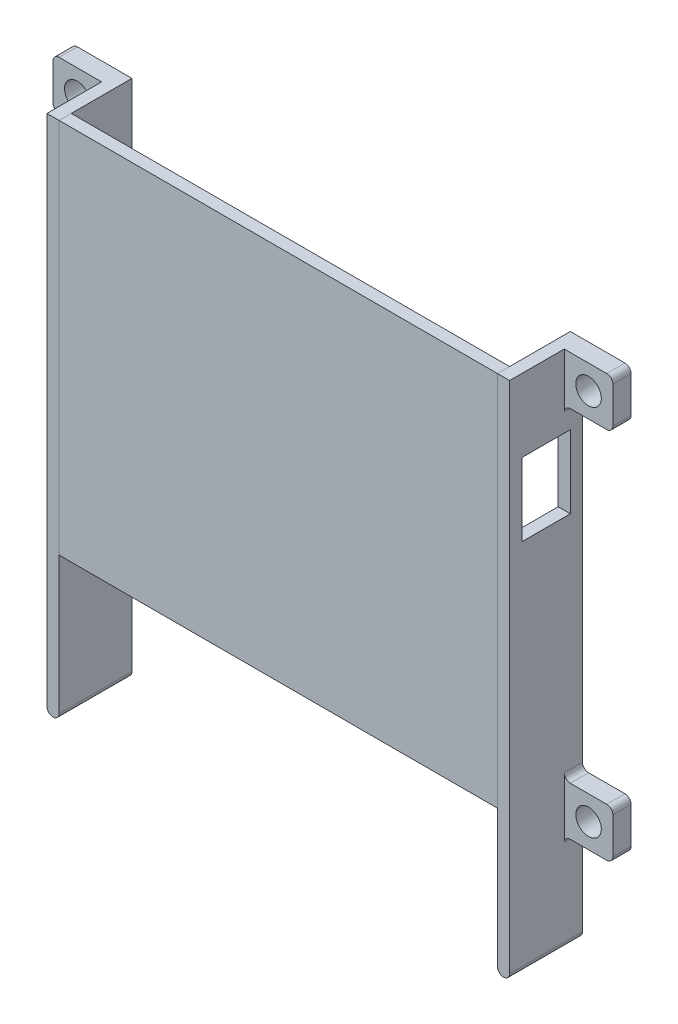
ISO-10303-21;
HEADER;
FILE_DESCRIPTION(('STEP AP214'),'2;1');
FILE_NAME('part.step','',(''),(''),'','','');
FILE_SCHEMA(('AUTOMOTIVE_DESIGN { 1 0 10303 214 1 1 1 1 }'));
ENDSEC;
DATA;
#1=APPLICATION_CONTEXT('core data for automotive mechanical design processes');
#2=APPLICATION_PROTOCOL_DEFINITION('international standard','automotive_design',2000,#1);
#3=PRODUCT_CONTEXT('',#1,'mechanical');
#4=PRODUCT('Part','Part','',(#3));
#5=PRODUCT_RELATED_PRODUCT_CATEGORY('part','',(#4));
#6=PRODUCT_DEFINITION_FORMATION('','',#4);
#7=PRODUCT_DEFINITION_CONTEXT('part definition',#1,'design');
#8=PRODUCT_DEFINITION('design','',#6,#7);
#9=PRODUCT_DEFINITION_SHAPE('','',#8);
#10=(LENGTH_UNIT() NAMED_UNIT(*) SI_UNIT(.MILLI.,.METRE.));
#11=(NAMED_UNIT(*) PLANE_ANGLE_UNIT() SI_UNIT($,.RADIAN.));
#12=(NAMED_UNIT(*) SI_UNIT($,.STERADIAN.) SOLID_ANGLE_UNIT());
#13=UNCERTAINTY_MEASURE_WITH_UNIT(LENGTH_MEASURE(1.E-05),#10,'distance_accuracy_value','');
#14=(GEOMETRIC_REPRESENTATION_CONTEXT(3) GLOBAL_UNCERTAINTY_ASSIGNED_CONTEXT((#13)) GLOBAL_UNIT_ASSIGNED_CONTEXT((#10,
#11,#12)) REPRESENTATION_CONTEXT('',''));
#15=CARTESIAN_POINT('',(0.,0.,0.));
#16=DIRECTION('',(0.,0.,1.));
#17=DIRECTION('',(1.,0.,0.));
#18=AXIS2_PLACEMENT_3D('',#15,#16,#17);
#19=CARTESIAN_POINT('',(19.05,0.,-5.));
#20=DIRECTION('',(-1.,0.,0.));
#21=DIRECTION('',(0.,-1.,0.));
#22=AXIS2_PLACEMENT_3D('',#19,#20,#21);
#23=PLANE('',#22);
#24=DIRECTION('',(0.,-1.,0.));
#25=VECTOR('',#24,1.);
#26=CARTESIAN_POINT('',(19.05,0.,-4.00000000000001));
#27=LINE('',#26,#25);
#28=CARTESIAN_POINT('',(19.05,9.5,-4.00000000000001));
#29=VERTEX_POINT('',#28);
#30=CARTESIAN_POINT('',(19.05,3.5,-4.00000000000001));
#31=VERTEX_POINT('',#30);
#32=EDGE_CURVE('E236',#29,#31,#27,.T.);
#33=ORIENTED_EDGE('',*,*,#32,.T.);
#34=DIRECTION('',(0.,0.,1.));
#35=VECTOR('',#34,1.);
#36=CARTESIAN_POINT('',(19.05,3.5,-5.));
#37=LINE('',#36,#35);
#38=CARTESIAN_POINT('',(19.05,3.5,0.));
#39=VERTEX_POINT('',#38);
#40=EDGE_CURVE('E228',#31,#39,#37,.T.);
#41=ORIENTED_EDGE('',*,*,#40,.T.);
#42=DIRECTION('',(0.,-1.,0.));
#43=VECTOR('',#42,1.);
#44=CARTESIAN_POINT('',(19.05,0.,0.));
#45=LINE('',#44,#43);
#46=CARTESIAN_POINT('',(19.05,9.5,0.));
#47=VERTEX_POINT('',#46);
#48=EDGE_CURVE('E211',#47,#39,#45,.T.);
#49=ORIENTED_EDGE('',*,*,#48,.F.);
#50=DIRECTION('',(0.,0.,1.));
#51=VECTOR('',#50,1.);
#52=CARTESIAN_POINT('',(19.05,9.5,-5.));
#53=LINE('',#52,#51);
#54=EDGE_CURVE('E222',#29,#47,#53,.T.);
#55=ORIENTED_EDGE('',*,*,#54,.F.);
#56=EDGE_LOOP('',(#33,#41,#49,#55));
#57=FACE_BOUND('',#56,.T.);
#58=DIRECTION('',(0.,-1.,0.));
#59=VECTOR('',#58,1.);
#60=CARTESIAN_POINT('',(19.05,0.,1.));
#61=LINE('',#60,#59);
#62=CARTESIAN_POINT('',(19.05,15.5,1.));
#63=VERTEX_POINT('',#62);
#64=CARTESIAN_POINT('',(19.05,-26.8,1.));
#65=VERTEX_POINT('',#64);
#66=EDGE_CURVE('E281',#63,#65,#61,.T.);
#67=ORIENTED_EDGE('',*,*,#66,.T.);
#68=DIRECTION('',(0.,0.,1.));
#69=VECTOR('',#68,1.);
#70=CARTESIAN_POINT('',(19.05,-26.8,-5.));
#71=LINE('',#70,#69);
#72=CARTESIAN_POINT('',(19.05,-26.8,-5.));
#73=VERTEX_POINT('',#72);
#74=EDGE_CURVE('E345',#65,#73,#71,.F.);
#75=ORIENTED_EDGE('',*,*,#74,.T.);
#76=DIRECTION('',(0.,-1.,0.));
#77=VECTOR('',#76,1.);
#78=CARTESIAN_POINT('',(19.05,0.,-5.));
#79=LINE('',#78,#77);
#80=CARTESIAN_POINT('',(19.05,-19.7198,-5.));
#81=VERTEX_POINT('',#80);
#82=EDGE_CURVE('E288',#81,#73,#79,.T.);
#83=ORIENTED_EDGE('',*,*,#82,.F.);
#84=DIRECTION('',(0.,0.,-1.));
#85=VECTOR('',#84,1.);
#86=CARTESIAN_POINT('',(19.05,-19.7198,-5.));
#87=LINE('',#86,#85);
#88=CARTESIAN_POINT('',(19.05,-19.7198,-3.5));
#89=VERTEX_POINT('',#88);
#90=EDGE_CURVE('E339',#81,#89,#87,.F.);
#91=ORIENTED_EDGE('',*,*,#90,.T.);
#92=DIRECTION('',(0.,-1.,0.));
#93=VECTOR('',#92,1.);
#94=CARTESIAN_POINT('',(19.05,0.,-3.5));
#95=LINE('',#94,#93);
#96=CARTESIAN_POINT('',(19.05,-14.7198,-3.5));
#97=VERTEX_POINT('',#96);
#98=EDGE_CURVE('E255',#97,#89,#95,.T.);
#99=ORIENTED_EDGE('',*,*,#98,.F.);
#100=DIRECTION('',(0.,0.,-1.));
#101=VECTOR('',#100,1.);
#102=CARTESIAN_POINT('',(19.05,-14.7198,-5.));
#103=LINE('',#102,#101);
#104=CARTESIAN_POINT('',(19.05,-14.7198,-5.));
#105=VERTEX_POINT('',#104);
#106=EDGE_CURVE('E342',#97,#105,#103,.T.);
#107=ORIENTED_EDGE('',*,*,#106,.T.);
#108=CARTESIAN_POINT('',(19.05,11.,-5.));
#109=VERTEX_POINT('',#108);
#110=EDGE_CURVE('E291',#109,#105,#79,.T.);
#111=ORIENTED_EDGE('',*,*,#110,.F.);
#112=DIRECTION('',(0.,0.,-1.));
#113=VECTOR('',#112,1.);
#114=CARTESIAN_POINT('',(19.05,11.,-5.));
#115=LINE('',#114,#113);
#116=CARTESIAN_POINT('',(19.05,11.,-3.5));
#117=VERTEX_POINT('',#116);
#118=EDGE_CURVE('E336',#109,#117,#115,.F.);
#119=ORIENTED_EDGE('',*,*,#118,.T.);
#120=DIRECTION('',(0.,-1.,0.));
#121=VECTOR('',#120,1.);
#122=CARTESIAN_POINT('',(19.05,0.,-3.5));
#123=LINE('',#122,#121);
#124=CARTESIAN_POINT('',(19.05,15.5,-3.5));
#125=VERTEX_POINT('',#124);
#126=EDGE_CURVE('E276',#125,#117,#123,.T.);
#127=ORIENTED_EDGE('',*,*,#126,.F.);
#128=DIRECTION('',(0.,0.,1.));
#129=VECTOR('',#128,1.);
#130=CARTESIAN_POINT('',(19.05,15.5,-5.));
#131=LINE('',#130,#129);
#132=EDGE_CURVE('E298',#125,#63,#131,.T.);
#133=ORIENTED_EDGE('',*,*,#132,.T.);
#134=EDGE_LOOP('',(#67,#75,#83,#91,#99,#107,#111,#119,#127,#133));
#135=FACE_BOUND('',#134,.T.);
#136=ADVANCED_FACE('F55',(#57,#135),#23,.F.);
#137=CARTESIAN_POINT('',(18.05,0.,-5.));
#138=DIRECTION('',(1.,0.,0.));
#139=DIRECTION('',(0.,0.,-1.));
#140=AXIS2_PLACEMENT_3D('',#137,#138,#139);
#141=PLANE('',#140);
#142=DIRECTION('',(0.,1.,0.));
#143=VECTOR('',#142,1.);
#144=CARTESIAN_POINT('',(18.05,0.,0.));
#145=LINE('',#144,#143);
#146=CARTESIAN_POINT('',(18.05,3.5,0.));
#147=VERTEX_POINT('',#146);
#148=CARTESIAN_POINT('',(18.05,9.5,0.));
#149=VERTEX_POINT('',#148);
#150=EDGE_CURVE('E308',#147,#149,#145,.T.);
#151=ORIENTED_EDGE('',*,*,#150,.F.);
#152=DIRECTION('',(0.,0.,-1.));
#153=VECTOR('',#152,1.);
#154=CARTESIAN_POINT('',(18.05,3.5,-5.));
#155=LINE('',#154,#153);
#156=CARTESIAN_POINT('',(18.05,3.5,-4.00000000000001));
#157=VERTEX_POINT('',#156);
#158=EDGE_CURVE('E231',#147,#157,#155,.T.);
#159=ORIENTED_EDGE('',*,*,#158,.T.);
#160=DIRECTION('',(0.,1.,0.));
#161=VECTOR('',#160,1.);
#162=CARTESIAN_POINT('',(18.05,0.,-4.00000000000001));
#163=LINE('',#162,#161);
#164=CARTESIAN_POINT('',(18.05,9.5,-4.00000000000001));
#165=VERTEX_POINT('',#164);
#166=EDGE_CURVE('E313',#157,#165,#163,.T.);
#167=ORIENTED_EDGE('',*,*,#166,.T.);
#168=DIRECTION('',(0.,0.,-1.));
#169=VECTOR('',#168,1.);
#170=CARTESIAN_POINT('',(18.05,9.5,-5.));
#171=LINE('',#170,#169);
#172=EDGE_CURVE('E311',#149,#165,#171,.T.);
#173=ORIENTED_EDGE('',*,*,#172,.F.);
#174=EDGE_LOOP('',(#151,#159,#167,#173));
#175=FACE_BOUND('',#174,.T.);
#176=DIRECTION('',(0.,1.,0.));
#177=VECTOR('',#176,1.);
#178=CARTESIAN_POINT('',(18.05,0.,-5.));
#179=LINE('',#178,#177);
#180=CARTESIAN_POINT('',(18.05,-26.8,-5.));
#181=VERTEX_POINT('',#180);
#182=CARTESIAN_POINT('',(18.05,15.5,-5.));
#183=VERTEX_POINT('',#182);
#184=EDGE_CURVE('E296',#181,#183,#179,.T.);
#185=ORIENTED_EDGE('',*,*,#184,.F.);
#186=DIRECTION('',(0.,0.,1.));
#187=VECTOR('',#186,1.);
#188=CARTESIAN_POINT('',(18.05,-26.8,1.));
#189=LINE('',#188,#187);
#190=CARTESIAN_POINT('',(18.05,-26.8,1.));
#191=VERTEX_POINT('',#190);
#192=EDGE_CURVE('E317',#181,#191,#189,.T.);
#193=ORIENTED_EDGE('',*,*,#192,.T.);
#194=DIRECTION('',(0.,1.,0.));
#195=VECTOR('',#194,1.);
#196=CARTESIAN_POINT('',(18.05,0.,1.));
#197=LINE('',#196,#195);
#198=CARTESIAN_POINT('',(18.05,15.5,1.));
#199=VERTEX_POINT('',#198);
#200=EDGE_CURVE('E292',#191,#199,#197,.T.);
#201=ORIENTED_EDGE('',*,*,#200,.T.);
#202=DIRECTION('',(0.,0.,1.));
#203=VECTOR('',#202,1.);
#204=CARTESIAN_POINT('',(18.05,15.5,-5.));
#205=LINE('',#204,#203);
#206=EDGE_CURVE('E305',#183,#199,#205,.T.);
#207=ORIENTED_EDGE('',*,*,#206,.F.);
#208=EDGE_LOOP('',(#185,#193,#201,#207));
#209=FACE_BOUND('',#208,.T.);
#210=ADVANCED_FACE('F440',(#175,#209),#141,.F.);
#211=CARTESIAN_POINT('',(0.,15.5,-5.));
#212=DIRECTION('',(0.,-1.,0.));
#213=DIRECTION('',(0.,0.,-1.));
#214=AXIS2_PLACEMENT_3D('',#211,#212,#213);
#215=PLANE('',#214);
#216=DIRECTION('',(-1.,0.,0.));
#217=VECTOR('',#216,1.);
#218=CARTESIAN_POINT('',(0.,15.5,-3.5));
#219=LINE('',#218,#217);
#220=CARTESIAN_POINT('',(22.55,15.5,-3.5));
#221=VERTEX_POINT('',#220);
#222=EDGE_CURVE('E268',#221,#125,#219,.T.);
#223=ORIENTED_EDGE('',*,*,#222,.F.);
#224=DIRECTION('',(0.,0.,-1.));
#225=VECTOR('',#224,1.);
#226=CARTESIAN_POINT('',(22.55,15.5,-5.));
#227=LINE('',#226,#225);
#228=CARTESIAN_POINT('',(22.55,15.5,-5.));
#229=VERTEX_POINT('',#228);
#230=EDGE_CURVE('E371',#221,#229,#227,.T.);
#231=ORIENTED_EDGE('',*,*,#230,.T.);
#232=DIRECTION('',(1.,0.,0.));
#233=VECTOR('',#232,1.);
#234=CARTESIAN_POINT('',(0.,15.5,-5.));
#235=LINE('',#234,#233);
#236=EDGE_CURVE('E293',#183,#229,#235,.T.);
#237=ORIENTED_EDGE('',*,*,#236,.F.);
#238=ORIENTED_EDGE('',*,*,#206,.T.);
#239=DIRECTION('',(1.,0.,0.));
#240=VECTOR('',#239,1.);
#241=CARTESIAN_POINT('',(0.,15.5,1.));
#242=LINE('',#241,#240);
#243=EDGE_CURVE('E301',#199,#63,#242,.T.);
#244=ORIENTED_EDGE('',*,*,#243,.T.);
#245=ORIENTED_EDGE('',*,*,#132,.F.);
#246=EDGE_LOOP('',(#223,#231,#237,#238,#244,#245));
#247=FACE_BOUND('',#246,.T.);
#248=ADVANCED_FACE('F419',(#247),#215,.F.);
#249=CARTESIAN_POINT('',(0.,0.,-5.));
#250=DIRECTION('',(0.,0.,1.));
#251=DIRECTION('',(1.,0.,0.));
#252=AXIS2_PLACEMENT_3D('',#249,#250,#251);
#253=PLANE('',#252);
#254=CARTESIAN_POINT('',(18.55,-26.8,-5.));
#255=DIRECTION('',(0.,0.,1.));
#256=DIRECTION('',(1.,0.,0.));
#257=AXIS2_PLACEMENT_3D('',#254,#255,#256);
#258=CIRCLE('',#257,0.5);
#259=CARTESIAN_POINT('',(18.55,-27.3,-5.));
#260=VERTEX_POINT('',#259);
#261=EDGE_CURVE('E332',#73,#260,#258,.F.);
#262=ORIENTED_EDGE('',*,*,#261,.T.);
#263=CARTESIAN_POINT('',(18.55,-26.8,-5.));
#264=DIRECTION('',(0.,0.,1.));
#265=DIRECTION('',(1.,0.,0.));
#266=AXIS2_PLACEMENT_3D('',#263,#264,#265);
#267=CIRCLE('',#266,0.5);
#268=EDGE_CURVE('E334',#260,#181,#267,.F.);
#269=ORIENTED_EDGE('',*,*,#268,.T.);
#270=ORIENTED_EDGE('',*,*,#184,.T.);
#271=ORIENTED_EDGE('',*,*,#236,.T.);
#272=CARTESIAN_POINT('',(22.55,15.,-5.));
#273=DIRECTION('',(0.,0.,1.));
#274=DIRECTION('',(1.,0.,0.));
#275=AXIS2_PLACEMENT_3D('',#272,#273,#274);
#276=CIRCLE('',#275,0.5);
#277=CARTESIAN_POINT('',(23.05,15.,-5.));
#278=VERTEX_POINT('',#277);
#279=EDGE_CURVE('E326',#229,#278,#276,.F.);
#280=ORIENTED_EDGE('',*,*,#279,.T.);
#281=DIRECTION('',(0.,1.,0.));
#282=VECTOR('',#281,1.);
#283=CARTESIAN_POINT('',(23.05,0.,-5.));
#284=LINE('',#283,#282);
#285=CARTESIAN_POINT('',(23.05,12.,-5.));
#286=VERTEX_POINT('',#285);
#287=EDGE_CURVE('E259',#286,#278,#284,.T.);
#288=ORIENTED_EDGE('',*,*,#287,.F.);
#289=CARTESIAN_POINT('',(22.55,12.,-5.));
#290=DIRECTION('',(0.,0.,1.));
#291=DIRECTION('',(1.,0.,0.));
#292=AXIS2_PLACEMENT_3D('',#289,#290,#291);
#293=CIRCLE('',#292,0.5);
#294=CARTESIAN_POINT('',(22.55,11.5,-5.));
#295=VERTEX_POINT('',#294);
#296=EDGE_CURVE('E324',#286,#295,#293,.F.);
#297=ORIENTED_EDGE('',*,*,#296,.T.);
#298=DIRECTION('',(-1.,0.,0.));
#299=VECTOR('',#298,1.);
#300=CARTESIAN_POINT('',(0.,11.5,-5.));
#301=LINE('',#300,#299);
#302=CARTESIAN_POINT('',(19.55,11.5,-5.));
#303=VERTEX_POINT('',#302);
#304=EDGE_CURVE('E283',#295,#303,#301,.T.);
#305=ORIENTED_EDGE('',*,*,#304,.T.);
#306=CARTESIAN_POINT('',(19.55,11.,-5.));
#307=DIRECTION('',(0.,0.,1.));
#308=DIRECTION('',(1.,0.,0.));
#309=AXIS2_PLACEMENT_3D('',#306,#307,#308);
#310=CIRCLE('',#309,0.5);
#311=EDGE_CURVE('E64',#303,#109,#310,.T.);
#312=ORIENTED_EDGE('',*,*,#311,.T.);
#313=ORIENTED_EDGE('',*,*,#110,.T.);
#314=CARTESIAN_POINT('',(19.55,-14.7198,-5.));
#315=DIRECTION('',(0.,0.,1.));
#316=DIRECTION('',(1.,0.,0.));
#317=AXIS2_PLACEMENT_3D('',#314,#315,#316);
#318=CIRCLE('',#317,0.5);
#319=CARTESIAN_POINT('',(19.55,-15.2198,-5.));
#320=VERTEX_POINT('',#319);
#321=EDGE_CURVE('E381',#105,#320,#318,.T.);
#322=ORIENTED_EDGE('',*,*,#321,.T.);
#323=DIRECTION('',(-1.,0.,0.));
#324=VECTOR('',#323,1.);
#325=CARTESIAN_POINT('',(0.,-15.2198,-5.));
#326=LINE('',#325,#324);
#327=CARTESIAN_POINT('',(22.55,-15.2198,-5.));
#328=VERTEX_POINT('',#327);
#329=EDGE_CURVE('E237',#328,#320,#326,.T.);
#330=ORIENTED_EDGE('',*,*,#329,.F.);
#331=CARTESIAN_POINT('',(22.55,-15.7198,-5.));
#332=DIRECTION('',(0.,0.,1.));
#333=DIRECTION('',(1.,0.,0.));
#334=AXIS2_PLACEMENT_3D('',#331,#332,#333);
#335=CIRCLE('',#334,0.5);
#336=CARTESIAN_POINT('',(23.05,-15.7198,-5.));
#337=VERTEX_POINT('',#336);
#338=EDGE_CURVE('E330',#328,#337,#335,.F.);
#339=ORIENTED_EDGE('',*,*,#338,.T.);
#340=DIRECTION('',(0.,1.,0.));
#341=VECTOR('',#340,1.);
#342=CARTESIAN_POINT('',(23.05,0.,-5.));
#343=LINE('',#342,#341);
#344=CARTESIAN_POINT('',(23.05,-18.7198,-5.));
#345=VERTEX_POINT('',#344);
#346=EDGE_CURVE('E240',#345,#337,#343,.T.);
#347=ORIENTED_EDGE('',*,*,#346,.F.);
#348=CARTESIAN_POINT('',(22.55,-18.7198,-5.));
#349=DIRECTION('',(0.,0.,1.));
#350=DIRECTION('',(1.,0.,0.));
#351=AXIS2_PLACEMENT_3D('',#348,#349,#350);
#352=CIRCLE('',#351,0.5);
#353=CARTESIAN_POINT('',(22.55,-19.2198,-5.));
#354=VERTEX_POINT('',#353);
#355=EDGE_CURVE('E328',#345,#354,#352,.F.);
#356=ORIENTED_EDGE('',*,*,#355,.T.);
#357=DIRECTION('',(-1.,0.,0.));
#358=VECTOR('',#357,1.);
#359=CARTESIAN_POINT('',(0.,-19.2198,-5.));
#360=LINE('',#359,#358);
#361=CARTESIAN_POINT('',(19.55,-19.2198,-5.));
#362=VERTEX_POINT('',#361);
#363=EDGE_CURVE('E263',#354,#362,#360,.T.);
#364=ORIENTED_EDGE('',*,*,#363,.T.);
#365=CARTESIAN_POINT('',(19.55,-19.7198,-5.));
#366=DIRECTION('',(0.,0.,1.));
#367=DIRECTION('',(1.,0.,0.));
#368=AXIS2_PLACEMENT_3D('',#365,#366,#367);
#369=CIRCLE('',#368,0.5);
#370=EDGE_CURVE('E386',#362,#81,#369,.T.);
#371=ORIENTED_EDGE('',*,*,#370,.T.);
#372=ORIENTED_EDGE('',*,*,#82,.T.);
#373=EDGE_LOOP('',(#262,#269,#270,#271,#280,#288,#297,#305,#312,#313,#322,#330,#339,#347,#356,
#364,#371,#372));
#374=FACE_BOUND('',#373,.T.);
#375=CARTESIAN_POINT('',(21.05,13.5,-5.));
#376=DIRECTION('',(0.,0.,-1.));
#377=DIRECTION('',(-1.,0.,0.));
#378=AXIS2_PLACEMENT_3D('',#375,#376,#377);
#379=CIRCLE('',#378,1.05);
#380=CARTESIAN_POINT('',(20.,13.5,-5.));
#381=VERTEX_POINT('',#380);
#382=EDGE_CURVE('E271',#381,#381,#379,.F.);
#383=ORIENTED_EDGE('',*,*,#382,.T.);
#384=EDGE_LOOP('',(#383));
#385=FACE_BOUND('',#384,.T.);
#386=CARTESIAN_POINT('',(21.05,-17.2198,-5.));
#387=DIRECTION('',(0.,0.,-1.));
#388=DIRECTION('',(-1.,0.,0.));
#389=AXIS2_PLACEMENT_3D('',#386,#387,#388);
#390=CIRCLE('',#389,1.05);
#391=CARTESIAN_POINT('',(20.,-17.2198,-5.));
#392=VERTEX_POINT('',#391);
#393=EDGE_CURVE('E249',#392,#392,#390,.F.);
#394=ORIENTED_EDGE('',*,*,#393,.T.);
#395=EDGE_LOOP('',(#394));
#396=FACE_BOUND('',#395,.T.);
#397=ADVANCED_FACE('F393',(#374,#385,#396),#253,.F.);
#398=CARTESIAN_POINT('',(0.,0.,1.));
#399=DIRECTION('',(0.,0.,1.));
#400=DIRECTION('',(1.,0.,0.));
#401=AXIS2_PLACEMENT_3D('',#398,#399,#400);
#402=PLANE('',#401);
#403=ORIENTED_EDGE('',*,*,#200,.F.);
#404=CARTESIAN_POINT('',(18.55,-26.8,1.));
#405=DIRECTION('',(0.,0.,1.));
#406=DIRECTION('',(1.,0.,0.));
#407=AXIS2_PLACEMENT_3D('',#404,#405,#406);
#408=CIRCLE('',#407,0.5);
#409=CARTESIAN_POINT('',(18.55,-27.3,1.));
#410=VERTEX_POINT('',#409);
#411=EDGE_CURVE('E322',#191,#410,#408,.T.);
#412=ORIENTED_EDGE('',*,*,#411,.T.);
#413=CARTESIAN_POINT('',(18.55,-26.8,1.));
#414=DIRECTION('',(0.,0.,1.));
#415=DIRECTION('',(1.,0.,0.));
#416=AXIS2_PLACEMENT_3D('',#413,#414,#415);
#417=CIRCLE('',#416,0.5);
#418=EDGE_CURVE('E320',#410,#65,#417,.T.);
#419=ORIENTED_EDGE('',*,*,#418,.T.);
#420=ORIENTED_EDGE('',*,*,#66,.F.);
#421=ORIENTED_EDGE('',*,*,#243,.F.);
#422=EDGE_LOOP('',(#403,#412,#419,#420,#421));
#423=FACE_BOUND('',#422,.T.);
#424=ADVANCED_FACE('F427',(#423),#402,.T.);
#425=CARTESIAN_POINT('',(0.,11.5,-3.5));
#426=DIRECTION('',(0.,-1.,0.));
#427=DIRECTION('',(0.,0.,-1.));
#428=AXIS2_PLACEMENT_3D('',#425,#426,#427);
#429=PLANE('',#428);
#430=DIRECTION('',(-1.,0.,0.));
#431=VECTOR('',#430,1.);
#432=CARTESIAN_POINT('',(0.,11.5,-3.5));
#433=LINE('',#432,#431);
#434=CARTESIAN_POINT('',(22.55,11.5,-3.5));
#435=VERTEX_POINT('',#434);
#436=CARTESIAN_POINT('',(19.55,11.5,-3.5));
#437=VERTEX_POINT('',#436);
#438=EDGE_CURVE('E273',#435,#437,#433,.T.);
#439=ORIENTED_EDGE('',*,*,#438,.T.);
#440=DIRECTION('',(0.,0.,-1.));
#441=VECTOR('',#440,1.);
#442=CARTESIAN_POINT('',(19.55,11.5,-3.5));
#443=LINE('',#442,#441);
#444=EDGE_CURVE('E368',#437,#303,#443,.T.);
#445=ORIENTED_EDGE('',*,*,#444,.T.);
#446=ORIENTED_EDGE('',*,*,#304,.F.);
#447=DIRECTION('',(0.,0.,-1.));
#448=VECTOR('',#447,1.);
#449=CARTESIAN_POINT('',(22.55,11.5,-3.5));
#450=LINE('',#449,#448);
#451=EDGE_CURVE('E366',#295,#435,#450,.F.);
#452=ORIENTED_EDGE('',*,*,#451,.T.);
#453=EDGE_LOOP('',(#439,#445,#446,#452));
#454=FACE_BOUND('',#453,.T.);
#455=ADVANCED_FACE('F406',(#454),#429,.T.);
#456=CARTESIAN_POINT('',(23.05,0.,-3.5));
#457=DIRECTION('',(-1.,0.,0.));
#458=DIRECTION('',(0.,0.,1.));
#459=AXIS2_PLACEMENT_3D('',#456,#457,#458);
#460=PLANE('',#459);
#461=ORIENTED_EDGE('',*,*,#287,.T.);
#462=DIRECTION('',(0.,0.,-1.));
#463=VECTOR('',#462,1.);
#464=CARTESIAN_POINT('',(23.05,15.,-3.5));
#465=LINE('',#464,#463);
#466=CARTESIAN_POINT('',(23.05,15.,-3.5));
#467=VERTEX_POINT('',#466);
#468=EDGE_CURVE('E71',#278,#467,#465,.F.);
#469=ORIENTED_EDGE('',*,*,#468,.T.);
#470=DIRECTION('',(0.,1.,0.));
#471=VECTOR('',#470,1.);
#472=CARTESIAN_POINT('',(23.05,0.,-3.5));
#473=LINE('',#472,#471);
#474=CARTESIAN_POINT('',(23.05,12.,-3.5));
#475=VERTEX_POINT('',#474);
#476=EDGE_CURVE('E270',#475,#467,#473,.T.);
#477=ORIENTED_EDGE('',*,*,#476,.F.);
#478=DIRECTION('',(0.,0.,-1.));
#479=VECTOR('',#478,1.);
#480=CARTESIAN_POINT('',(23.05,12.,-5.));
#481=LINE('',#480,#479);
#482=EDGE_CURVE('E374',#475,#286,#481,.T.);
#483=ORIENTED_EDGE('',*,*,#482,.T.);
#484=EDGE_LOOP('',(#461,#469,#477,#483));
#485=FACE_BOUND('',#484,.T.);
#486=ADVANCED_FACE('F411',(#485),#460,.F.);
#487=CARTESIAN_POINT('',(21.05,13.5,-3.5));
#488=DIRECTION('',(0.,0.,-1.));
#489=DIRECTION('',(-1.,0.,0.));
#490=AXIS2_PLACEMENT_3D('',#487,#488,#489);
#491=CYLINDRICAL_SURFACE('',#490,1.05);
#492=CARTESIAN_POINT('',(21.05,13.5,-3.5));
#493=DIRECTION('',(0.,0.,-1.));
#494=DIRECTION('',(-1.,0.,0.));
#495=AXIS2_PLACEMENT_3D('',#492,#493,#494);
#496=CIRCLE('',#495,1.05);
#497=CARTESIAN_POINT('',(20.,13.5,-3.5));
#498=VERTEX_POINT('',#497);
#499=EDGE_CURVE('E278',#498,#498,#496,.F.);
#500=ORIENTED_EDGE('',*,*,#499,.T.);
#501=EDGE_LOOP('',(#500));
#502=FACE_BOUND('',#501,.T.);
#503=ORIENTED_EDGE('',*,*,#382,.F.);
#504=EDGE_LOOP('',(#503));
#505=FACE_BOUND('',#504,.T.);
#506=ADVANCED_FACE('F580',(#502,#505),#491,.F.);
#507=CARTESIAN_POINT('',(0.,0.,-3.5));
#508=DIRECTION('',(0.,0.,-1.));
#509=DIRECTION('',(-1.,0.,0.));
#510=AXIS2_PLACEMENT_3D('',#507,#508,#509);
#511=PLANE('',#510);
#512=ORIENTED_EDGE('',*,*,#476,.T.);
#513=CARTESIAN_POINT('',(22.55,15.,-3.5));
#514=DIRECTION('',(0.,0.,-1.));
#515=DIRECTION('',(-1.,0.,0.));
#516=AXIS2_PLACEMENT_3D('',#513,#514,#515);
#517=CIRCLE('',#516,0.5);
#518=EDGE_CURVE('E379',#467,#221,#517,.F.);
#519=ORIENTED_EDGE('',*,*,#518,.T.);
#520=ORIENTED_EDGE('',*,*,#222,.T.);
#521=ORIENTED_EDGE('',*,*,#126,.T.);
#522=CARTESIAN_POINT('',(19.55,11.,-3.5));
#523=DIRECTION('',(0.,0.,-1.));
#524=DIRECTION('',(-1.,0.,0.));
#525=AXIS2_PLACEMENT_3D('',#522,#523,#524);
#526=CIRCLE('',#525,0.5);
#527=EDGE_CURVE('E12',#117,#437,#526,.T.);
#528=ORIENTED_EDGE('',*,*,#527,.T.);
#529=ORIENTED_EDGE('',*,*,#438,.F.);
#530=CARTESIAN_POINT('',(22.55,12.,-3.5));
#531=DIRECTION('',(0.,0.,-1.));
#532=DIRECTION('',(-1.,0.,0.));
#533=AXIS2_PLACEMENT_3D('',#530,#531,#532);
#534=CIRCLE('',#533,0.5);
#535=EDGE_CURVE('E78',#435,#475,#534,.F.);
#536=ORIENTED_EDGE('',*,*,#535,.T.);
#537=EDGE_LOOP('',(#512,#519,#520,#521,#528,#529,#536));
#538=FACE_BOUND('',#537,.T.);
#539=ORIENTED_EDGE('',*,*,#499,.F.);
#540=EDGE_LOOP('',(#539));
#541=FACE_BOUND('',#540,.T.);
#542=ADVANCED_FACE('F403',(#538,#541),#511,.F.);
#543=CARTESIAN_POINT('',(0.,-15.2198,-3.5));
#544=DIRECTION('',(0.,-1.,0.));
#545=DIRECTION('',(0.,0.,-1.));
#546=AXIS2_PLACEMENT_3D('',#543,#544,#545);
#547=PLANE('',#546);
#548=ORIENTED_EDGE('',*,*,#329,.T.);
#549=DIRECTION('',(0.,0.,-1.));
#550=VECTOR('',#549,1.);
#551=CARTESIAN_POINT('',(19.55,-15.2198,-3.5));
#552=LINE('',#551,#550);
#553=CARTESIAN_POINT('',(19.55,-15.2198,-3.5));
#554=VERTEX_POINT('',#553);
#555=EDGE_CURVE('E350',#320,#554,#552,.F.);
#556=ORIENTED_EDGE('',*,*,#555,.T.);
#557=DIRECTION('',(-1.,0.,0.));
#558=VECTOR('',#557,1.);
#559=CARTESIAN_POINT('',(0.,-15.2198,-3.5));
#560=LINE('',#559,#558);
#561=CARTESIAN_POINT('',(22.55,-15.2198,-3.5));
#562=VERTEX_POINT('',#561);
#563=EDGE_CURVE('E245',#562,#554,#560,.T.);
#564=ORIENTED_EDGE('',*,*,#563,.F.);
#565=DIRECTION('',(0.,0.,-1.));
#566=VECTOR('',#565,1.);
#567=CARTESIAN_POINT('',(22.55,-15.2198,-3.5));
#568=LINE('',#567,#566);
#569=EDGE_CURVE('E347',#562,#328,#568,.T.);
#570=ORIENTED_EDGE('',*,*,#569,.T.);
#571=EDGE_LOOP('',(#548,#556,#564,#570));
#572=FACE_BOUND('',#571,.T.);
#573=ADVANCED_FACE('F565',(#572),#547,.F.);
#574=CARTESIAN_POINT('',(0.,-19.2198,-3.5));
#575=DIRECTION('',(0.,-1.,0.));
#576=DIRECTION('',(0.,0.,-1.));
#577=AXIS2_PLACEMENT_3D('',#574,#575,#576);
#578=PLANE('',#577);
#579=DIRECTION('',(-1.,0.,0.));
#580=VECTOR('',#579,1.);
#581=CARTESIAN_POINT('',(0.,-19.2198,-3.5));
#582=LINE('',#581,#580);
#583=CARTESIAN_POINT('',(22.55,-19.2198,-3.5));
#584=VERTEX_POINT('',#583);
#585=CARTESIAN_POINT('',(19.55,-19.2198,-3.5));
#586=VERTEX_POINT('',#585);
#587=EDGE_CURVE('E252',#584,#586,#582,.T.);
#588=ORIENTED_EDGE('',*,*,#587,.T.);
#589=DIRECTION('',(0.,0.,-1.));
#590=VECTOR('',#589,1.);
#591=CARTESIAN_POINT('',(19.55,-19.2198,-3.5));
#592=LINE('',#591,#590);
#593=EDGE_CURVE('E363',#586,#362,#592,.T.);
#594=ORIENTED_EDGE('',*,*,#593,.T.);
#595=ORIENTED_EDGE('',*,*,#363,.F.);
#596=DIRECTION('',(0.,0.,-1.));
#597=VECTOR('',#596,1.);
#598=CARTESIAN_POINT('',(22.55,-19.2198,-3.5));
#599=LINE('',#598,#597);
#600=EDGE_CURVE('E361',#354,#584,#599,.F.);
#601=ORIENTED_EDGE('',*,*,#600,.T.);
#602=EDGE_LOOP('',(#588,#594,#595,#601));
#603=FACE_BOUND('',#602,.T.);
#604=ADVANCED_FACE('F557',(#603),#578,.T.);
#605=CARTESIAN_POINT('',(23.05,0.,-3.5));
#606=DIRECTION('',(-1.,0.,0.));
#607=DIRECTION('',(0.,0.,1.));
#608=AXIS2_PLACEMENT_3D('',#605,#606,#607);
#609=PLANE('',#608);
#610=ORIENTED_EDGE('',*,*,#346,.T.);
#611=DIRECTION('',(0.,0.,-1.));
#612=VECTOR('',#611,1.);
#613=CARTESIAN_POINT('',(23.05,-15.7198,-3.5));
#614=LINE('',#613,#612);
#615=CARTESIAN_POINT('',(23.05,-15.7198,-3.5));
#616=VERTEX_POINT('',#615);
#617=EDGE_CURVE('E355',#337,#616,#614,.F.);
#618=ORIENTED_EDGE('',*,*,#617,.T.);
#619=DIRECTION('',(0.,1.,0.));
#620=VECTOR('',#619,1.);
#621=CARTESIAN_POINT('',(23.05,0.,-3.5));
#622=LINE('',#621,#620);
#623=CARTESIAN_POINT('',(23.05,-18.7198,-3.5));
#624=VERTEX_POINT('',#623);
#625=EDGE_CURVE('E248',#624,#616,#622,.T.);
#626=ORIENTED_EDGE('',*,*,#625,.F.);
#627=DIRECTION('',(0.,0.,-1.));
#628=VECTOR('',#627,1.);
#629=CARTESIAN_POINT('',(23.05,-18.7198,-5.));
#630=LINE('',#629,#628);
#631=EDGE_CURVE('E352',#624,#345,#630,.T.);
#632=ORIENTED_EDGE('',*,*,#631,.T.);
#633=EDGE_LOOP('',(#610,#618,#626,#632));
#634=FACE_BOUND('',#633,.T.);
#635=ADVANCED_FACE('F553',(#634),#609,.F.);
#636=CARTESIAN_POINT('',(21.05,-17.2198,-3.5));
#637=DIRECTION('',(0.,0.,-1.));
#638=DIRECTION('',(-1.,0.,0.));
#639=AXIS2_PLACEMENT_3D('',#636,#637,#638);
#640=CYLINDRICAL_SURFACE('',#639,1.05);
#641=CARTESIAN_POINT('',(21.05,-17.2198,-3.5));
#642=DIRECTION('',(0.,0.,-1.));
#643=DIRECTION('',(-1.,0.,0.));
#644=AXIS2_PLACEMENT_3D('',#641,#642,#643);
#645=CIRCLE('',#644,1.05);
#646=CARTESIAN_POINT('',(20.,-17.2198,-3.5));
#647=VERTEX_POINT('',#646);
#648=EDGE_CURVE('E257',#647,#647,#645,.F.);
#649=ORIENTED_EDGE('',*,*,#648,.T.);
#650=EDGE_LOOP('',(#649));
#651=FACE_BOUND('',#650,.T.);
#652=ORIENTED_EDGE('',*,*,#393,.F.);
#653=EDGE_LOOP('',(#652));
#654=FACE_BOUND('',#653,.T.);
#655=ADVANCED_FACE('F546',(#651,#654),#640,.F.);
#656=CARTESIAN_POINT('',(0.,0.,-3.5));
#657=DIRECTION('',(0.,0.,-1.));
#658=DIRECTION('',(-1.,0.,0.));
#659=AXIS2_PLACEMENT_3D('',#656,#657,#658);
#660=PLANE('',#659);
#661=ORIENTED_EDGE('',*,*,#625,.T.);
#662=CARTESIAN_POINT('',(22.55,-15.7198,-3.5));
#663=DIRECTION('',(0.,0.,-1.));
#664=DIRECTION('',(-1.,0.,0.));
#665=AXIS2_PLACEMENT_3D('',#662,#663,#664);
#666=CIRCLE('',#665,0.5);
#667=EDGE_CURVE('E359',#616,#562,#666,.F.);
#668=ORIENTED_EDGE('',*,*,#667,.T.);
#669=ORIENTED_EDGE('',*,*,#563,.T.);
#670=CARTESIAN_POINT('',(19.55,-14.7198,-3.5));
#671=DIRECTION('',(0.,0.,-1.));
#672=DIRECTION('',(-1.,0.,0.));
#673=AXIS2_PLACEMENT_3D('',#670,#671,#672);
#674=CIRCLE('',#673,0.5);
#675=EDGE_CURVE('E383',#554,#97,#674,.T.);
#676=ORIENTED_EDGE('',*,*,#675,.T.);
#677=ORIENTED_EDGE('',*,*,#98,.T.);
#678=CARTESIAN_POINT('',(19.55,-19.7198,-3.5));
#679=DIRECTION('',(0.,0.,-1.));
#680=DIRECTION('',(-1.,0.,0.));
#681=AXIS2_PLACEMENT_3D('',#678,#679,#680);
#682=CIRCLE('',#681,0.5);
#683=EDGE_CURVE('E388',#89,#586,#682,.T.);
#684=ORIENTED_EDGE('',*,*,#683,.T.);
#685=ORIENTED_EDGE('',*,*,#587,.F.);
#686=CARTESIAN_POINT('',(22.55,-18.7198,-3.5));
#687=DIRECTION('',(0.,0.,-1.));
#688=DIRECTION('',(-1.,0.,0.));
#689=AXIS2_PLACEMENT_3D('',#686,#687,#688);
#690=CIRCLE('',#689,0.5);
#691=EDGE_CURVE('E357',#584,#624,#690,.F.);
#692=ORIENTED_EDGE('',*,*,#691,.T.);
#693=EDGE_LOOP('',(#661,#668,#669,#676,#677,#684,#685,#692));
#694=FACE_BOUND('',#693,.T.);
#695=ORIENTED_EDGE('',*,*,#648,.F.);
#696=EDGE_LOOP('',(#695));
#697=FACE_BOUND('',#696,.T.);
#698=ADVANCED_FACE('F542',(#694,#697),#660,.F.);
#699=CARTESIAN_POINT('',(23.05,3.5,-4.00000000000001));
#700=DIRECTION('',(0.,-1.,0.));
#701=DIRECTION('',(0.,0.,-1.));
#702=AXIS2_PLACEMENT_3D('',#699,#700,#701);
#703=PLANE('',#702);
#704=DIRECTION('',(-1.,0.,0.));
#705=VECTOR('',#704,1.);
#706=CARTESIAN_POINT('',(23.05,3.5,-4.00000000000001));
#707=LINE('',#706,#705);
#708=EDGE_CURVE('E223',#31,#157,#707,.T.);
#709=ORIENTED_EDGE('',*,*,#708,.T.);
#710=ORIENTED_EDGE('',*,*,#158,.F.);
#711=DIRECTION('',(-1.,0.,0.));
#712=VECTOR('',#711,1.);
#713=CARTESIAN_POINT('',(23.05,3.5,0.));
#714=LINE('',#713,#712);
#715=EDGE_CURVE('E214',#39,#147,#714,.T.);
#716=ORIENTED_EDGE('',*,*,#715,.F.);
#717=ORIENTED_EDGE('',*,*,#40,.F.);
#718=EDGE_LOOP('',(#709,#710,#716,#717));
#719=FACE_BOUND('',#718,.T.);
#720=ADVANCED_FACE('F227',(#719),#703,.F.);
#721=CARTESIAN_POINT('',(23.05,9.5,-4.00000000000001));
#722=DIRECTION('',(0.,0.,-1.));
#723=DIRECTION('',(0.,1.,0.));
#724=AXIS2_PLACEMENT_3D('',#721,#722,#723);
#725=PLANE('',#724);
#726=DIRECTION('',(-1.,0.,0.));
#727=VECTOR('',#726,1.);
#728=CARTESIAN_POINT('',(23.05,9.5,-4.00000000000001));
#729=LINE('',#728,#727);
#730=EDGE_CURVE('E759',#29,#165,#729,.T.);
#731=ORIENTED_EDGE('',*,*,#730,.T.);
#732=ORIENTED_EDGE('',*,*,#166,.F.);
#733=ORIENTED_EDGE('',*,*,#708,.F.);
#734=ORIENTED_EDGE('',*,*,#32,.F.);
#735=EDGE_LOOP('',(#731,#732,#733,#734));
#736=FACE_BOUND('',#735,.T.);
#737=ADVANCED_FACE('F639',(#736),#725,.F.);
#738=CARTESIAN_POINT('',(23.05,9.5,-4.00000000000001));
#739=DIRECTION('',(0.,-1.,0.));
#740=DIRECTION('',(0.,0.,-1.));
#741=AXIS2_PLACEMENT_3D('',#738,#739,#740);
#742=PLANE('',#741);
#743=ORIENTED_EDGE('',*,*,#54,.T.);
#744=DIRECTION('',(-1.,0.,0.));
#745=VECTOR('',#744,1.);
#746=CARTESIAN_POINT('',(23.05,9.5,0.));
#747=LINE('',#746,#745);
#748=EDGE_CURVE('E217',#47,#149,#747,.T.);
#749=ORIENTED_EDGE('',*,*,#748,.T.);
#750=ORIENTED_EDGE('',*,*,#172,.T.);
#751=ORIENTED_EDGE('',*,*,#730,.F.);
#752=EDGE_LOOP('',(#743,#749,#750,#751));
#753=FACE_BOUND('',#752,.T.);
#754=ADVANCED_FACE('F629',(#753),#742,.T.);
#755=CARTESIAN_POINT('',(23.05,9.5,0.));
#756=DIRECTION('',(0.,0.,-1.));
#757=DIRECTION('',(0.,1.,0.));
#758=AXIS2_PLACEMENT_3D('',#755,#756,#757);
#759=PLANE('',#758);
#760=ORIENTED_EDGE('',*,*,#48,.T.);
#761=ORIENTED_EDGE('',*,*,#715,.T.);
#762=ORIENTED_EDGE('',*,*,#150,.T.);
#763=ORIENTED_EDGE('',*,*,#748,.F.);
#764=EDGE_LOOP('',(#760,#761,#762,#763));
#765=FACE_BOUND('',#764,.T.);
#766=ADVANCED_FACE('F213',(#765),#759,.T.);
#767=CARTESIAN_POINT('',(18.55,-26.8,-5.));
#768=DIRECTION('',(0.,0.,-1.));
#769=DIRECTION('',(-1.,0.,0.));
#770=AXIS2_PLACEMENT_3D('',#767,#768,#769);
#771=CYLINDRICAL_SURFACE('',#770,0.5);
#772=DIRECTION('',(0.,0.,1.));
#773=VECTOR('',#772,1.);
#774=CARTESIAN_POINT('',(18.55,-27.3,1.));
#775=LINE('',#774,#773);
#776=EDGE_CURVE('E59',#260,#410,#775,.T.);
#777=ORIENTED_EDGE('',*,*,#776,.F.);
#778=ORIENTED_EDGE('',*,*,#261,.F.);
#779=ORIENTED_EDGE('',*,*,#74,.F.);
#780=ORIENTED_EDGE('',*,*,#418,.F.);
#781=EDGE_LOOP('',(#777,#778,#779,#780));
#782=FACE_BOUND('',#781,.T.);
#783=ADVANCED_FACE('F432',(#782),#771,.T.);
#784=CARTESIAN_POINT('',(18.55,-26.8,-5.));
#785=DIRECTION('',(0.,0.,-1.));
#786=DIRECTION('',(-1.,0.,0.));
#787=AXIS2_PLACEMENT_3D('',#784,#785,#786);
#788=CYLINDRICAL_SURFACE('',#787,0.5);
#789=ORIENTED_EDGE('',*,*,#268,.F.);
#790=ORIENTED_EDGE('',*,*,#776,.T.);
#791=ORIENTED_EDGE('',*,*,#411,.F.);
#792=ORIENTED_EDGE('',*,*,#192,.F.);
#793=EDGE_LOOP('',(#789,#790,#791,#792));
#794=FACE_BOUND('',#793,.T.);
#795=ADVANCED_FACE('F436',(#794),#788,.T.);
#796=CARTESIAN_POINT('',(19.55,-14.7198,-5.));
#797=DIRECTION('',(0.,0.,1.));
#798=DIRECTION('',(1.,0.,0.));
#799=AXIS2_PLACEMENT_3D('',#796,#797,#798);
#800=CYLINDRICAL_SURFACE('',#799,0.5);
#801=ORIENTED_EDGE('',*,*,#675,.F.);
#802=ORIENTED_EDGE('',*,*,#555,.F.);
#803=ORIENTED_EDGE('',*,*,#321,.F.);
#804=ORIENTED_EDGE('',*,*,#106,.F.);
#805=EDGE_LOOP('',(#801,#802,#803,#804));
#806=FACE_BOUND('',#805,.T.);
#807=ADVANCED_FACE('F455',(#806),#800,.F.);
#808=CARTESIAN_POINT('',(22.55,-15.7198,-3.5));
#809=DIRECTION('',(0.,0.,-1.));
#810=DIRECTION('',(-1.,0.,0.));
#811=AXIS2_PLACEMENT_3D('',#808,#809,#810);
#812=CYLINDRICAL_SURFACE('',#811,0.5);
#813=ORIENTED_EDGE('',*,*,#667,.F.);
#814=ORIENTED_EDGE('',*,*,#617,.F.);
#815=ORIENTED_EDGE('',*,*,#338,.F.);
#816=ORIENTED_EDGE('',*,*,#569,.F.);
#817=EDGE_LOOP('',(#813,#814,#815,#816));
#818=FACE_BOUND('',#817,.T.);
#819=ADVANCED_FACE('F460',(#818),#812,.T.);
#820=CARTESIAN_POINT('',(19.55,-19.7198,-3.5));
#821=DIRECTION('',(0.,0.,-1.));
#822=DIRECTION('',(-1.,0.,0.));
#823=AXIS2_PLACEMENT_3D('',#820,#821,#822);
#824=CYLINDRICAL_SURFACE('',#823,0.5);
#825=ORIENTED_EDGE('',*,*,#683,.F.);
#826=ORIENTED_EDGE('',*,*,#90,.F.);
#827=ORIENTED_EDGE('',*,*,#370,.F.);
#828=ORIENTED_EDGE('',*,*,#593,.F.);
#829=EDGE_LOOP('',(#825,#826,#827,#828));
#830=FACE_BOUND('',#829,.T.);
#831=ADVANCED_FACE('F464',(#830),#824,.F.);
#832=CARTESIAN_POINT('',(22.55,-18.7198,-3.5));
#833=DIRECTION('',(0.,0.,1.));
#834=DIRECTION('',(1.,0.,0.));
#835=AXIS2_PLACEMENT_3D('',#832,#833,#834);
#836=CYLINDRICAL_SURFACE('',#835,0.5);
#837=ORIENTED_EDGE('',*,*,#691,.F.);
#838=ORIENTED_EDGE('',*,*,#600,.F.);
#839=ORIENTED_EDGE('',*,*,#355,.F.);
#840=ORIENTED_EDGE('',*,*,#631,.F.);
#841=EDGE_LOOP('',(#837,#838,#839,#840));
#842=FACE_BOUND('',#841,.T.);
#843=ADVANCED_FACE('F468',(#842),#836,.T.);
#844=CARTESIAN_POINT('',(19.55,11.,-3.5));
#845=DIRECTION('',(0.,0.,-1.));
#846=DIRECTION('',(-1.,0.,0.));
#847=AXIS2_PLACEMENT_3D('',#844,#845,#846);
#848=CYLINDRICAL_SURFACE('',#847,0.5);
#849=ORIENTED_EDGE('',*,*,#527,.F.);
#850=ORIENTED_EDGE('',*,*,#118,.F.);
#851=ORIENTED_EDGE('',*,*,#311,.F.);
#852=ORIENTED_EDGE('',*,*,#444,.F.);
#853=EDGE_LOOP('',(#849,#850,#851,#852));
#854=FACE_BOUND('',#853,.T.);
#855=ADVANCED_FACE('F402',(#854),#848,.F.);
#856=CARTESIAN_POINT('',(22.55,15.,-5.));
#857=DIRECTION('',(0.,0.,-1.));
#858=DIRECTION('',(-1.,0.,0.));
#859=AXIS2_PLACEMENT_3D('',#856,#857,#858);
#860=CYLINDRICAL_SURFACE('',#859,0.5);
#861=ORIENTED_EDGE('',*,*,#518,.F.);
#862=ORIENTED_EDGE('',*,*,#468,.F.);
#863=ORIENTED_EDGE('',*,*,#279,.F.);
#864=ORIENTED_EDGE('',*,*,#230,.F.);
#865=EDGE_LOOP('',(#861,#862,#863,#864));
#866=FACE_BOUND('',#865,.T.);
#867=ADVANCED_FACE('F416',(#866),#860,.T.);
#868=CARTESIAN_POINT('',(22.55,12.,-3.5));
#869=DIRECTION('',(0.,0.,1.));
#870=DIRECTION('',(1.,0.,0.));
#871=AXIS2_PLACEMENT_3D('',#868,#869,#870);
#872=CYLINDRICAL_SURFACE('',#871,0.5);
#873=ORIENTED_EDGE('',*,*,#535,.F.);
#874=ORIENTED_EDGE('',*,*,#451,.F.);
#875=ORIENTED_EDGE('',*,*,#296,.F.);
#876=ORIENTED_EDGE('',*,*,#482,.F.);
#877=EDGE_LOOP('',(#873,#874,#875,#876));
#878=FACE_BOUND('',#877,.T.);
#879=ADVANCED_FACE('F57',(#878),#872,.T.);
#880=CLOSED_SHELL('',(#136,#210,#248,#397,#424,#455,#486,#506,#542,#573,#604,#635,#655,#698,
#720,#737,#754,#766,#783,#795,#807,#819,#831,#843,#855,#867,#879));
#881=MANIFOLD_SOLID_BREP('B2',#880);
#882=CARTESIAN_POINT('',(-19.05,0.,-5.));
#883=DIRECTION('',(-1.,0.,0.));
#884=DIRECTION('',(0.,0.,1.));
#885=AXIS2_PLACEMENT_3D('',#882,#883,#884);
#886=PLANE('',#885);
#887=DIRECTION('',(0.,0.,1.));
#888=VECTOR('',#887,1.);
#889=CARTESIAN_POINT('',(-19.05,3.5,-4.00000000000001));
#890=LINE('',#889,#888);
#891=CARTESIAN_POINT('',(-19.05,3.5,-4.00000000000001));
#892=VERTEX_POINT('',#891);
#893=CARTESIAN_POINT('',(-19.05,3.5,0.));
#894=VERTEX_POINT('',#893);
#895=EDGE_CURVE('E971',#892,#894,#890,.T.);
#896=ORIENTED_EDGE('',*,*,#895,.F.);
#897=DIRECTION('',(0.,-1.,0.));
#898=VECTOR('',#897,1.);
#899=CARTESIAN_POINT('',(-19.05,9.5,-4.00000000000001));
#900=LINE('',#899,#898);
#901=CARTESIAN_POINT('',(-19.05,9.5,-4.00000000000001));
#902=VERTEX_POINT('',#901);
#903=EDGE_CURVE('E975',#902,#892,#900,.T.);
#904=ORIENTED_EDGE('',*,*,#903,.F.);
#905=DIRECTION('',(0.,0.,1.));
#906=VECTOR('',#905,1.);
#907=CARTESIAN_POINT('',(-19.05,9.5,-4.00000000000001));
#908=LINE('',#907,#906);
#909=CARTESIAN_POINT('',(-19.05,9.5,0.));
#910=VERTEX_POINT('',#909);
#911=EDGE_CURVE('E955',#902,#910,#908,.T.);
#912=ORIENTED_EDGE('',*,*,#911,.T.);
#913=DIRECTION('',(0.,-1.,0.));
#914=VECTOR('',#913,1.);
#915=CARTESIAN_POINT('',(-19.05,9.5,0.));
#916=LINE('',#915,#914);
#917=EDGE_CURVE('E966',#910,#894,#916,.T.);
#918=ORIENTED_EDGE('',*,*,#917,.T.);
#919=EDGE_LOOP('',(#896,#904,#912,#918));
#920=FACE_BOUND('',#919,.T.);
#921=DIRECTION('',(0.,-1.,0.));
#922=VECTOR('',#921,1.);
#923=CARTESIAN_POINT('',(-19.05,0.,-5.));
#924=LINE('',#923,#922);
#925=CARTESIAN_POINT('',(-19.05,11.,-5.));
#926=VERTEX_POINT('',#925);
#927=CARTESIAN_POINT('',(-19.05,-14.7198,-5.));
#928=VERTEX_POINT('',#927);
#929=EDGE_CURVE('E1040',#926,#928,#924,.T.);
#930=ORIENTED_EDGE('',*,*,#929,.T.);
#931=DIRECTION('',(0.,0.,1.));
#932=VECTOR('',#931,1.);
#933=CARTESIAN_POINT('',(-19.05,-14.7198,-5.));
#934=LINE('',#933,#932);
#935=CARTESIAN_POINT('',(-19.05,-14.7198,-3.5));
#936=VERTEX_POINT('',#935);
#937=EDGE_CURVE('E1070',#928,#936,#934,.T.);
#938=ORIENTED_EDGE('',*,*,#937,.T.);
#939=DIRECTION('',(0.,-1.,0.));
#940=VECTOR('',#939,1.);
#941=CARTESIAN_POINT('',(-19.05,0.,-3.5));
#942=LINE('',#941,#940);
#943=CARTESIAN_POINT('',(-19.05,-19.7198,-3.5));
#944=VERTEX_POINT('',#943);
#945=EDGE_CURVE('E1001',#936,#944,#942,.T.);
#946=ORIENTED_EDGE('',*,*,#945,.T.);
#947=DIRECTION('',(0.,0.,1.));
#948=VECTOR('',#947,1.);
#949=CARTESIAN_POINT('',(-19.05,-19.7198,-5.));
#950=LINE('',#949,#948);
#951=CARTESIAN_POINT('',(-19.05,-19.7198,-5.));
#952=VERTEX_POINT('',#951);
#953=EDGE_CURVE('E1065',#944,#952,#950,.F.);
#954=ORIENTED_EDGE('',*,*,#953,.T.);
#955=CARTESIAN_POINT('',(-19.05,-26.8,-5.));
#956=VERTEX_POINT('',#955);
#957=EDGE_CURVE('E1039',#952,#956,#924,.T.);
#958=ORIENTED_EDGE('',*,*,#957,.T.);
#959=DIRECTION('',(0.,0.,1.));
#960=VECTOR('',#959,1.);
#961=CARTESIAN_POINT('',(-19.05,-26.8,1.));
#962=LINE('',#961,#960);
#963=CARTESIAN_POINT('',(-19.05,-26.8,1.));
#964=VERTEX_POINT('',#963);
#965=EDGE_CURVE('E1067',#956,#964,#962,.T.);
#966=ORIENTED_EDGE('',*,*,#965,.T.);
#967=DIRECTION('',(0.,-1.,0.));
#968=VECTOR('',#967,1.);
#969=CARTESIAN_POINT('',(-19.05,0.,1.));
#970=LINE('',#969,#968);
#971=CARTESIAN_POINT('',(-19.05,15.5,1.));
#972=VERTEX_POINT('',#971);
#973=EDGE_CURVE('E1037',#972,#964,#970,.T.);
#974=ORIENTED_EDGE('',*,*,#973,.F.);
#975=DIRECTION('',(0.,0.,1.));
#976=VECTOR('',#975,1.);
#977=CARTESIAN_POINT('',(-19.05,15.5,-5.));
#978=LINE('',#977,#976);
#979=CARTESIAN_POINT('',(-19.05,15.5,-3.5));
#980=VERTEX_POINT('',#979);
#981=EDGE_CURVE('E1051',#980,#972,#978,.T.);
#982=ORIENTED_EDGE('',*,*,#981,.F.);
#983=DIRECTION('',(0.,-1.,0.));
#984=VECTOR('',#983,1.);
#985=CARTESIAN_POINT('',(-19.05,0.,-3.5));
#986=LINE('',#985,#984);
#987=CARTESIAN_POINT('',(-19.05,11.,-3.5));
#988=VERTEX_POINT('',#987);
#989=EDGE_CURVE('E1016',#980,#988,#986,.T.);
#990=ORIENTED_EDGE('',*,*,#989,.T.);
#991=DIRECTION('',(0.,0.,1.));
#992=VECTOR('',#991,1.);
#993=CARTESIAN_POINT('',(-19.05,11.,-5.));
#994=LINE('',#993,#992);
#995=EDGE_CURVE('E1063',#988,#926,#994,.F.);
#996=ORIENTED_EDGE('',*,*,#995,.T.);
#997=EDGE_LOOP('',(#930,#938,#946,#954,#958,#966,#974,#982,#990,#996));
#998=FACE_BOUND('',#997,.T.);
#999=ADVANCED_FACE('F793',(#920,#998),#886,.T.);
#1000=CARTESIAN_POINT('',(-18.05,0.,-5.));
#1001=DIRECTION('',(-1.,0.,0.));
#1002=DIRECTION('',(0.,0.,1.));
#1003=AXIS2_PLACEMENT_3D('',#1000,#1001,#1002);
#1004=PLANE('',#1003);
#1005=DIRECTION('',(0.,-1.,0.));
#1006=VECTOR('',#1005,1.);
#1007=CARTESIAN_POINT('',(-18.05,0.,-4.00000000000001));
#1008=LINE('',#1007,#1006);
#1009=CARTESIAN_POINT('',(-18.05,9.5,-4.00000000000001));
#1010=VERTEX_POINT('',#1009);
#1011=CARTESIAN_POINT('',(-18.05,3.5,-4.00000000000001));
#1012=VERTEX_POINT('',#1011);
#1013=EDGE_CURVE('E1057',#1010,#1012,#1008,.T.);
#1014=ORIENTED_EDGE('',*,*,#1013,.T.);
#1015=DIRECTION('',(0.,0.,1.));
#1016=VECTOR('',#1015,1.);
#1017=CARTESIAN_POINT('',(-18.05,3.5,-5.));
#1018=LINE('',#1017,#1016);
#1019=CARTESIAN_POINT('',(-18.05,3.5,0.));
#1020=VERTEX_POINT('',#1019);
#1021=EDGE_CURVE('E1060',#1012,#1020,#1018,.T.);
#1022=ORIENTED_EDGE('',*,*,#1021,.T.);
#1023=DIRECTION('',(0.,-1.,0.));
#1024=VECTOR('',#1023,1.);
#1025=CARTESIAN_POINT('',(-18.05,0.,0.));
#1026=LINE('',#1025,#1024);
#1027=CARTESIAN_POINT('',(-18.05,9.5,0.));
#1028=VERTEX_POINT('',#1027);
#1029=EDGE_CURVE('E1053',#1028,#1020,#1026,.T.);
#1030=ORIENTED_EDGE('',*,*,#1029,.F.);
#1031=DIRECTION('',(0.,0.,1.));
#1032=VECTOR('',#1031,1.);
#1033=CARTESIAN_POINT('',(-18.05,9.5,-5.));
#1034=LINE('',#1033,#1032);
#1035=EDGE_CURVE('E958',#1010,#1028,#1034,.T.);
#1036=ORIENTED_EDGE('',*,*,#1035,.F.);
#1037=EDGE_LOOP('',(#1014,#1022,#1030,#1036));
#1038=FACE_BOUND('',#1037,.T.);
#1039=DIRECTION('',(0.,-1.,0.));
#1040=VECTOR('',#1039,1.);
#1041=CARTESIAN_POINT('',(-18.05,0.,1.));
#1042=LINE('',#1041,#1040);
#1043=CARTESIAN_POINT('',(-18.05,15.5,1.));
#1044=VERTEX_POINT('',#1043);
#1045=CARTESIAN_POINT('',(-18.05,-26.8,1.));
#1046=VERTEX_POINT('',#1045);
#1047=EDGE_CURVE('E1032',#1044,#1046,#1042,.T.);
#1048=ORIENTED_EDGE('',*,*,#1047,.T.);
#1049=DIRECTION('',(0.,0.,1.));
#1050=VECTOR('',#1049,1.);
#1051=CARTESIAN_POINT('',(-18.05,-26.8,-5.));
#1052=LINE('',#1051,#1050);
#1053=CARTESIAN_POINT('',(-18.05,-26.8,-5.));
#1054=VERTEX_POINT('',#1053);
#1055=EDGE_CURVE('E1094',#1046,#1054,#1052,.F.);
#1056=ORIENTED_EDGE('',*,*,#1055,.T.);
#1057=DIRECTION('',(0.,-1.,0.));
#1058=VECTOR('',#1057,1.);
#1059=CARTESIAN_POINT('',(-18.05,0.,-5.));
#1060=LINE('',#1059,#1058);
#1061=CARTESIAN_POINT('',(-18.05,15.5,-5.));
#1062=VERTEX_POINT('',#1061);
#1063=EDGE_CURVE('E1033',#1062,#1054,#1060,.T.);
#1064=ORIENTED_EDGE('',*,*,#1063,.F.);
#1065=DIRECTION('',(0.,0.,1.));
#1066=VECTOR('',#1065,1.);
#1067=CARTESIAN_POINT('',(-18.05,15.5,-5.));
#1068=LINE('',#1067,#1066);
#1069=EDGE_CURVE('E1043',#1062,#1044,#1068,.T.);
#1070=ORIENTED_EDGE('',*,*,#1069,.T.);
#1071=EDGE_LOOP('',(#1048,#1056,#1064,#1070));
#1072=FACE_BOUND('',#1071,.T.);
#1073=ADVANCED_FACE('F1201',(#1038,#1072),#1004,.F.);
#1074=CARTESIAN_POINT('',(0.,15.5000000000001,-5.));
#1075=DIRECTION('',(0.,1.,0.));
#1076=DIRECTION('',(-1.,0.,0.));
#1077=AXIS2_PLACEMENT_3D('',#1074,#1075,#1076);
#1078=PLANE('',#1077);
#1079=DIRECTION('',(-1.,0.,0.));
#1080=VECTOR('',#1079,1.);
#1081=CARTESIAN_POINT('',(0.,15.5000000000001,-5.));
#1082=LINE('',#1081,#1080);
#1083=CARTESIAN_POINT('',(-22.55,15.5,-5.));
#1084=VERTEX_POINT('',#1083);
#1085=EDGE_CURVE('E1036',#1062,#1084,#1082,.T.);
#1086=ORIENTED_EDGE('',*,*,#1085,.T.);
#1087=DIRECTION('',(0.,0.,-1.));
#1088=VECTOR('',#1087,1.);
#1089=CARTESIAN_POINT('',(-22.55,15.5,-5.));
#1090=LINE('',#1089,#1088);
#1091=CARTESIAN_POINT('',(-22.55,15.5,-3.5));
#1092=VERTEX_POINT('',#1091);
#1093=EDGE_CURVE('E809',#1084,#1092,#1090,.F.);
#1094=ORIENTED_EDGE('',*,*,#1093,.T.);
#1095=DIRECTION('',(1.,0.,0.));
#1096=VECTOR('',#1095,1.);
#1097=CARTESIAN_POINT('',(-23.05,15.5,-3.5));
#1098=LINE('',#1097,#1096);
#1099=EDGE_CURVE('E1030',#1092,#980,#1098,.T.);
#1100=ORIENTED_EDGE('',*,*,#1099,.T.);
#1101=ORIENTED_EDGE('',*,*,#981,.T.);
#1102=DIRECTION('',(-1.,0.,0.));
#1103=VECTOR('',#1102,1.);
#1104=CARTESIAN_POINT('',(0.,15.5000000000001,1.));
#1105=LINE('',#1104,#1103);
#1106=EDGE_CURVE('E1046',#1044,#972,#1105,.T.);
#1107=ORIENTED_EDGE('',*,*,#1106,.F.);
#1108=ORIENTED_EDGE('',*,*,#1069,.F.);
#1109=EDGE_LOOP('',(#1086,#1094,#1100,#1101,#1107,#1108));
#1110=FACE_BOUND('',#1109,.T.);
#1111=ADVANCED_FACE('F1207',(#1110),#1078,.T.);
#1112=CARTESIAN_POINT('',(0.,0.,-5.));
#1113=DIRECTION('',(0.,0.,1.));
#1114=DIRECTION('',(1.,0.,0.));
#1115=AXIS2_PLACEMENT_3D('',#1112,#1113,#1114);
#1116=PLANE('',#1115);
#1117=CARTESIAN_POINT('',(-21.05,13.5,-5.));
#1118=DIRECTION('',(0.,0.,1.));
#1119=DIRECTION('',(1.,0.,0.));
#1120=AXIS2_PLACEMENT_3D('',#1117,#1118,#1119);
#1121=CIRCLE('',#1120,1.05);
#1122=CARTESIAN_POINT('',(-20.,13.5,-5.));
#1123=VERTEX_POINT('',#1122);
#1124=EDGE_CURVE('E1013',#1123,#1123,#1121,.T.);
#1125=ORIENTED_EDGE('',*,*,#1124,.T.);
#1126=EDGE_LOOP('',(#1125));
#1127=FACE_BOUND('',#1126,.T.);
#1128=CARTESIAN_POINT('',(-18.55,-26.8,-5.));
#1129=DIRECTION('',(0.,0.,1.));
#1130=DIRECTION('',(1.,0.,0.));
#1131=AXIS2_PLACEMENT_3D('',#1128,#1129,#1130);
#1132=CIRCLE('',#1131,0.5);
#1133=CARTESIAN_POINT('',(-18.55,-27.3,-5.));
#1134=VERTEX_POINT('',#1133);
#1135=EDGE_CURVE('E1090',#1054,#1134,#1132,.F.);
#1136=ORIENTED_EDGE('',*,*,#1135,.T.);
#1137=CARTESIAN_POINT('',(-18.55,-26.8,-5.));
#1138=DIRECTION('',(0.,0.,1.));
#1139=DIRECTION('',(1.,0.,0.));
#1140=AXIS2_PLACEMENT_3D('',#1137,#1138,#1139);
#1141=CIRCLE('',#1140,0.5);
#1142=EDGE_CURVE('E1092',#1134,#956,#1141,.F.);
#1143=ORIENTED_EDGE('',*,*,#1142,.T.);
#1144=ORIENTED_EDGE('',*,*,#957,.F.);
#1145=CARTESIAN_POINT('',(-19.55,-19.7198,-5.));
#1146=DIRECTION('',(0.,0.,1.));
#1147=DIRECTION('',(1.,0.,0.));
#1148=AXIS2_PLACEMENT_3D('',#1145,#1146,#1147);
#1149=CIRCLE('',#1148,0.5);
#1150=CARTESIAN_POINT('',(-19.55,-19.2198,-5.));
#1151=VERTEX_POINT('',#1150);
#1152=EDGE_CURVE('E1131',#952,#1151,#1149,.T.);
#1153=ORIENTED_EDGE('',*,*,#1152,.T.);
#1154=DIRECTION('',(1.,0.,0.));
#1155=VECTOR('',#1154,1.);
#1156=CARTESIAN_POINT('',(0.,-19.2198,-5.));
#1157=LINE('',#1156,#1155);
#1158=CARTESIAN_POINT('',(-22.55,-19.2198,-5.));
#1159=VERTEX_POINT('',#1158);
#1160=EDGE_CURVE('E995',#1159,#1151,#1157,.T.);
#1161=ORIENTED_EDGE('',*,*,#1160,.F.);
#1162=CARTESIAN_POINT('',(-22.55,-18.7198,-5.));
#1163=DIRECTION('',(0.,0.,1.));
#1164=DIRECTION('',(1.,0.,0.));
#1165=AXIS2_PLACEMENT_3D('',#1162,#1163,#1164);
#1166=CIRCLE('',#1165,0.5);
#1167=CARTESIAN_POINT('',(-23.05,-18.7198,-5.));
#1168=VERTEX_POINT('',#1167);
#1169=EDGE_CURVE('E1086',#1159,#1168,#1166,.F.);
#1170=ORIENTED_EDGE('',*,*,#1169,.T.);
#1171=DIRECTION('',(0.,-1.,0.));
#1172=VECTOR('',#1171,1.);
#1173=CARTESIAN_POINT('',(-23.05,0.,-5.));
#1174=LINE('',#1173,#1172);
#1175=CARTESIAN_POINT('',(-23.05,-15.7198,-5.));
#1176=VERTEX_POINT('',#1175);
#1177=EDGE_CURVE('E992',#1176,#1168,#1174,.T.);
#1178=ORIENTED_EDGE('',*,*,#1177,.F.);
#1179=CARTESIAN_POINT('',(-22.55,-15.7198,-5.));
#1180=DIRECTION('',(0.,0.,1.));
#1181=DIRECTION('',(1.,0.,0.));
#1182=AXIS2_PLACEMENT_3D('',#1179,#1180,#1181);
#1183=CIRCLE('',#1182,0.5);
#1184=CARTESIAN_POINT('',(-22.55,-15.2198,-5.));
#1185=VERTEX_POINT('',#1184);
#1186=EDGE_CURVE('E1088',#1176,#1185,#1183,.F.);
#1187=ORIENTED_EDGE('',*,*,#1186,.T.);
#1188=DIRECTION('',(1.,0.,0.));
#1189=VECTOR('',#1188,1.);
#1190=CARTESIAN_POINT('',(0.,-15.2198,-5.));
#1191=LINE('',#1190,#1189);
#1192=CARTESIAN_POINT('',(-19.55,-15.2198,-5.));
#1193=VERTEX_POINT('',#1192);
#1194=EDGE_CURVE('E988',#1185,#1193,#1191,.T.);
#1195=ORIENTED_EDGE('',*,*,#1194,.T.);
#1196=CARTESIAN_POINT('',(-19.55,-14.7198,-5.));
#1197=DIRECTION('',(0.,0.,1.));
#1198=DIRECTION('',(1.,0.,0.));
#1199=AXIS2_PLACEMENT_3D('',#1196,#1197,#1198);
#1200=CIRCLE('',#1199,0.5);
#1201=EDGE_CURVE('E1126',#1193,#928,#1200,.T.);
#1202=ORIENTED_EDGE('',*,*,#1201,.T.);
#1203=ORIENTED_EDGE('',*,*,#929,.F.);
#1204=CARTESIAN_POINT('',(-19.55,11.,-5.));
#1205=DIRECTION('',(0.,0.,1.));
#1206=DIRECTION('',(1.,0.,0.));
#1207=AXIS2_PLACEMENT_3D('',#1204,#1205,#1206);
#1208=CIRCLE('',#1207,0.5);
#1209=CARTESIAN_POINT('',(-19.55,11.5,-5.));
#1210=VERTEX_POINT('',#1209);
#1211=EDGE_CURVE('E53',#926,#1210,#1208,.T.);
#1212=ORIENTED_EDGE('',*,*,#1211,.T.);
#1213=DIRECTION('',(1.,0.,0.));
#1214=VECTOR('',#1213,1.);
#1215=CARTESIAN_POINT('',(-23.05,11.5,-5.));
#1216=LINE('',#1215,#1214);
#1217=CARTESIAN_POINT('',(-22.55,11.5,-5.));
#1218=VERTEX_POINT('',#1217);
#1219=EDGE_CURVE('E1027',#1218,#1210,#1216,.T.);
#1220=ORIENTED_EDGE('',*,*,#1219,.F.);
#1221=CARTESIAN_POINT('',(-22.55,12.,-5.));
#1222=DIRECTION('',(0.,0.,1.));
#1223=DIRECTION('',(1.,0.,0.));
#1224=AXIS2_PLACEMENT_3D('',#1221,#1222,#1223);
#1225=CIRCLE('',#1224,0.5);
#1226=CARTESIAN_POINT('',(-23.05,12.,-5.));
#1227=VERTEX_POINT('',#1226);
#1228=EDGE_CURVE('E1084',#1218,#1227,#1225,.F.);
#1229=ORIENTED_EDGE('',*,*,#1228,.T.);
#1230=DIRECTION('',(0.,-1.,0.));
#1231=VECTOR('',#1230,1.);
#1232=CARTESIAN_POINT('',(-23.05,0.,-5.));
#1233=LINE('',#1232,#1231);
#1234=CARTESIAN_POINT('',(-23.05,15.,-5.));
#1235=VERTEX_POINT('',#1234);
#1236=EDGE_CURVE('E1020',#1235,#1227,#1233,.T.);
#1237=ORIENTED_EDGE('',*,*,#1236,.F.);
#1238=CARTESIAN_POINT('',(-22.55,15.,-5.));
#1239=DIRECTION('',(0.,0.,1.));
#1240=DIRECTION('',(1.,0.,0.));
#1241=AXIS2_PLACEMENT_3D('',#1238,#1239,#1240);
#1242=CIRCLE('',#1241,0.5);
#1243=EDGE_CURVE('E1082',#1235,#1084,#1242,.F.);
#1244=ORIENTED_EDGE('',*,*,#1243,.T.);
#1245=ORIENTED_EDGE('',*,*,#1085,.F.);
#1246=ORIENTED_EDGE('',*,*,#1063,.T.);
#1247=EDGE_LOOP('',(#1136,#1143,#1144,#1153,#1161,#1170,#1178,#1187,#1195,#1202,#1203,#1212,
#1220,#1229,#1237,#1244,#1245,#1246));
#1248=FACE_BOUND('',#1247,.T.);
#1249=CARTESIAN_POINT('',(-21.05,-17.2198,-5.));
#1250=DIRECTION('',(0.,0.,1.));
#1251=DIRECTION('',(1.,0.,0.));
#1252=AXIS2_PLACEMENT_3D('',#1249,#1250,#1251);
#1253=CIRCLE('',#1252,1.05);
#1254=CARTESIAN_POINT('',(-20.,-17.2198,-5.));
#1255=VERTEX_POINT('',#1254);
#1256=EDGE_CURVE('E985',#1255,#1255,#1253,.T.);
#1257=ORIENTED_EDGE('',*,*,#1256,.T.);
#1258=EDGE_LOOP('',(#1257));
#1259=FACE_BOUND('',#1258,.T.);
#1260=ADVANCED_FACE('F1147',(#1127,#1248,#1259),#1116,.F.);
#1261=CARTESIAN_POINT('',(0.,0.,1.));
#1262=DIRECTION('',(0.,0.,1.));
#1263=DIRECTION('',(1.,0.,0.));
#1264=AXIS2_PLACEMENT_3D('',#1261,#1262,#1263);
#1265=PLANE('',#1264);
#1266=ORIENTED_EDGE('',*,*,#973,.T.);
#1267=CARTESIAN_POINT('',(-18.55,-26.8,1.));
#1268=DIRECTION('',(0.,0.,1.));
#1269=DIRECTION('',(1.,0.,0.));
#1270=AXIS2_PLACEMENT_3D('',#1267,#1268,#1269);
#1271=CIRCLE('',#1270,0.5);
#1272=CARTESIAN_POINT('',(-18.55,-27.3,1.));
#1273=VERTEX_POINT('',#1272);
#1274=EDGE_CURVE('E1080',#964,#1273,#1271,.T.);
#1275=ORIENTED_EDGE('',*,*,#1274,.T.);
#1276=CARTESIAN_POINT('',(-18.55,-26.8,1.));
#1277=DIRECTION('',(0.,0.,1.));
#1278=DIRECTION('',(1.,0.,0.));
#1279=AXIS2_PLACEMENT_3D('',#1276,#1277,#1278);
#1280=CIRCLE('',#1279,0.5);
#1281=EDGE_CURVE('E1078',#1273,#1046,#1280,.T.);
#1282=ORIENTED_EDGE('',*,*,#1281,.T.);
#1283=ORIENTED_EDGE('',*,*,#1047,.F.);
#1284=ORIENTED_EDGE('',*,*,#1106,.T.);
#1285=EDGE_LOOP('',(#1266,#1275,#1282,#1283,#1284));
#1286=FACE_BOUND('',#1285,.T.);
#1287=ADVANCED_FACE('F1212',(#1286),#1265,.T.);
#1288=CARTESIAN_POINT('',(-23.05,0.,-3.5));
#1289=DIRECTION('',(0.,0.,1.));
#1290=DIRECTION('',(0.,-1.,0.));
#1291=AXIS2_PLACEMENT_3D('',#1288,#1289,#1290);
#1292=PLANE('',#1291);
#1293=CARTESIAN_POINT('',(-21.05,13.5,-3.5));
#1294=DIRECTION('',(0.,0.,1.));
#1295=DIRECTION('',(1.,0.,0.));
#1296=AXIS2_PLACEMENT_3D('',#1293,#1294,#1295);
#1297=CIRCLE('',#1296,1.05);
#1298=CARTESIAN_POINT('',(-20.,13.5,-3.5));
#1299=VERTEX_POINT('',#1298);
#1300=EDGE_CURVE('E998',#1299,#1299,#1297,.T.);
#1301=ORIENTED_EDGE('',*,*,#1300,.F.);
#1302=EDGE_LOOP('',(#1301));
#1303=FACE_BOUND('',#1302,.T.);
#1304=DIRECTION('',(0.,-1.,0.));
#1305=VECTOR('',#1304,1.);
#1306=CARTESIAN_POINT('',(-23.05,0.,-3.5));
#1307=LINE('',#1306,#1305);
#1308=CARTESIAN_POINT('',(-23.05,15.,-3.5));
#1309=VERTEX_POINT('',#1308);
#1310=CARTESIAN_POINT('',(-23.05,12.,-3.5));
#1311=VERTEX_POINT('',#1310);
#1312=EDGE_CURVE('E1017',#1309,#1311,#1307,.T.);
#1313=ORIENTED_EDGE('',*,*,#1312,.T.);
#1314=CARTESIAN_POINT('',(-22.55,12.,-3.5));
#1315=DIRECTION('',(0.,0.,1.));
#1316=DIRECTION('',(0.,-1.,0.));
#1317=AXIS2_PLACEMENT_3D('',#1314,#1315,#1316);
#1318=CIRCLE('',#1317,0.5);
#1319=CARTESIAN_POINT('',(-22.55,11.5,-3.5));
#1320=VERTEX_POINT('',#1319);
#1321=EDGE_CURVE('E817',#1311,#1320,#1318,.T.);
#1322=ORIENTED_EDGE('',*,*,#1321,.T.);
#1323=DIRECTION('',(1.,0.,0.));
#1324=VECTOR('',#1323,1.);
#1325=CARTESIAN_POINT('',(-23.05,11.5,-3.5));
#1326=LINE('',#1325,#1324);
#1327=CARTESIAN_POINT('',(-19.55,11.5,-3.5));
#1328=VERTEX_POINT('',#1327);
#1329=EDGE_CURVE('E1023',#1320,#1328,#1326,.T.);
#1330=ORIENTED_EDGE('',*,*,#1329,.T.);
#1331=CARTESIAN_POINT('',(-19.55,11.,-3.5));
#1332=DIRECTION('',(0.,0.,1.));
#1333=DIRECTION('',(0.,-1.,0.));
#1334=AXIS2_PLACEMENT_3D('',#1331,#1332,#1333);
#1335=CIRCLE('',#1334,0.5);
#1336=EDGE_CURVE('E802',#1328,#988,#1335,.F.);
#1337=ORIENTED_EDGE('',*,*,#1336,.T.);
#1338=ORIENTED_EDGE('',*,*,#989,.F.);
#1339=ORIENTED_EDGE('',*,*,#1099,.F.);
#1340=CARTESIAN_POINT('',(-22.55,15.,-3.5));
#1341=DIRECTION('',(0.,0.,1.));
#1342=DIRECTION('',(0.,-1.,0.));
#1343=AXIS2_PLACEMENT_3D('',#1340,#1341,#1342);
#1344=CIRCLE('',#1343,0.5);
#1345=EDGE_CURVE('E1120',#1092,#1309,#1344,.T.);
#1346=ORIENTED_EDGE('',*,*,#1345,.T.);
#1347=EDGE_LOOP('',(#1313,#1322,#1330,#1337,#1338,#1339,#1346));
#1348=FACE_BOUND('',#1347,.T.);
#1349=ADVANCED_FACE('F1137',(#1303,#1348),#1292,.T.);
#1350=CARTESIAN_POINT('',(-23.05,11.5,0.));
#1351=DIRECTION('',(0.,1.,0.));
#1352=DIRECTION('',(0.,0.,1.));
#1353=AXIS2_PLACEMENT_3D('',#1350,#1351,#1352);
#1354=PLANE('',#1353);
#1355=ORIENTED_EDGE('',*,*,#1219,.T.);
#1356=DIRECTION('',(0.,0.,1.));
#1357=VECTOR('',#1356,1.);
#1358=CARTESIAN_POINT('',(-19.55,11.5,0.));
#1359=LINE('',#1358,#1357);
#1360=EDGE_CURVE('E1112',#1210,#1328,#1359,.T.);
#1361=ORIENTED_EDGE('',*,*,#1360,.T.);
#1362=ORIENTED_EDGE('',*,*,#1329,.F.);
#1363=DIRECTION('',(0.,0.,1.));
#1364=VECTOR('',#1363,1.);
#1365=CARTESIAN_POINT('',(-22.55,11.5,-5.));
#1366=LINE('',#1365,#1364);
#1367=EDGE_CURVE('E1110',#1320,#1218,#1366,.F.);
#1368=ORIENTED_EDGE('',*,*,#1367,.T.);
#1369=EDGE_LOOP('',(#1355,#1361,#1362,#1368));
#1370=FACE_BOUND('',#1369,.T.);
#1371=ADVANCED_FACE('F1265',(#1370),#1354,.F.);
#1372=CARTESIAN_POINT('',(-23.05,0.,0.));
#1373=DIRECTION('',(-1.,0.,0.));
#1374=DIRECTION('',(0.,0.,1.));
#1375=AXIS2_PLACEMENT_3D('',#1372,#1373,#1374);
#1376=PLANE('',#1375);
#1377=ORIENTED_EDGE('',*,*,#1236,.T.);
#1378=DIRECTION('',(0.,0.,1.));
#1379=VECTOR('',#1378,1.);
#1380=CARTESIAN_POINT('',(-23.05,12.,-3.5));
#1381=LINE('',#1380,#1379);
#1382=EDGE_CURVE('E1118',#1227,#1311,#1381,.T.);
#1383=ORIENTED_EDGE('',*,*,#1382,.T.);
#1384=ORIENTED_EDGE('',*,*,#1312,.F.);
#1385=DIRECTION('',(0.,0.,-1.));
#1386=VECTOR('',#1385,1.);
#1387=CARTESIAN_POINT('',(-23.05,15.,0.));
#1388=LINE('',#1387,#1386);
#1389=EDGE_CURVE('E1115',#1309,#1235,#1388,.T.);
#1390=ORIENTED_EDGE('',*,*,#1389,.T.);
#1391=EDGE_LOOP('',(#1377,#1383,#1384,#1390));
#1392=FACE_BOUND('',#1391,.T.);
#1393=ADVANCED_FACE('F1242',(#1392),#1376,.T.);
#1394=CARTESIAN_POINT('',(-21.05,13.5,-7.5));
#1395=DIRECTION('',(0.,0.,1.));
#1396=DIRECTION('',(1.,0.,0.));
#1397=AXIS2_PLACEMENT_3D('',#1394,#1395,#1396);
#1398=CYLINDRICAL_SURFACE('',#1397,1.05);
#1399=ORIENTED_EDGE('',*,*,#1300,.T.);
#1400=EDGE_LOOP('',(#1399));
#1401=FACE_BOUND('',#1400,.T.);
#1402=ORIENTED_EDGE('',*,*,#1124,.F.);
#1403=EDGE_LOOP('',(#1402));
#1404=FACE_BOUND('',#1403,.T.);
#1405=ADVANCED_FACE('F1277',(#1401,#1404),#1398,.F.);
#1406=CARTESIAN_POINT('',(0.,-19.2198,-5.));
#1407=DIRECTION('',(0.,-1.,0.));
#1408=DIRECTION('',(0.,0.,-1.));
#1409=AXIS2_PLACEMENT_3D('',#1406,#1407,#1408);
#1410=PLANE('',#1409);
#1411=ORIENTED_EDGE('',*,*,#1160,.T.);
#1412=DIRECTION('',(0.,0.,1.));
#1413=VECTOR('',#1412,1.);
#1414=CARTESIAN_POINT('',(-19.55,-19.2198,-3.5));
#1415=LINE('',#1414,#1413);
#1416=CARTESIAN_POINT('',(-19.55,-19.2198,-3.5));
#1417=VERTEX_POINT('',#1416);
#1418=EDGE_CURVE('E1098',#1151,#1417,#1415,.T.);
#1419=ORIENTED_EDGE('',*,*,#1418,.T.);
#1420=DIRECTION('',(1.,0.,0.));
#1421=VECTOR('',#1420,1.);
#1422=CARTESIAN_POINT('',(0.,-19.2198,-3.5));
#1423=LINE('',#1422,#1421);
#1424=CARTESIAN_POINT('',(-22.55,-19.2198,-3.5));
#1425=VERTEX_POINT('',#1424);
#1426=EDGE_CURVE('E989',#1425,#1417,#1423,.T.);
#1427=ORIENTED_EDGE('',*,*,#1426,.F.);
#1428=DIRECTION('',(0.,0.,1.));
#1429=VECTOR('',#1428,1.);
#1430=CARTESIAN_POINT('',(-22.55,-19.2198,-5.));
#1431=LINE('',#1430,#1429);
#1432=EDGE_CURVE('E1096',#1425,#1159,#1431,.F.);
#1433=ORIENTED_EDGE('',*,*,#1432,.T.);
#1434=EDGE_LOOP('',(#1411,#1419,#1427,#1433));
#1435=FACE_BOUND('',#1434,.T.);
#1436=ADVANCED_FACE('F1170',(#1435),#1410,.T.);
#1437=CARTESIAN_POINT('',(-23.05,0.,-5.));
#1438=DIRECTION('',(-1.,0.,0.));
#1439=DIRECTION('',(0.,0.,1.));
#1440=AXIS2_PLACEMENT_3D('',#1437,#1438,#1439);
#1441=PLANE('',#1440);
#1442=DIRECTION('',(0.,-1.,0.));
#1443=VECTOR('',#1442,1.);
#1444=CARTESIAN_POINT('',(-23.05,0.,-3.5));
#1445=LINE('',#1444,#1443);
#1446=CARTESIAN_POINT('',(-23.05,-15.7198,-3.5));
#1447=VERTEX_POINT('',#1446);
#1448=CARTESIAN_POINT('',(-23.05,-18.7198,-3.5));
#1449=VERTEX_POINT('',#1448);
#1450=EDGE_CURVE('E1006',#1447,#1449,#1445,.T.);
#1451=ORIENTED_EDGE('',*,*,#1450,.F.);
#1452=DIRECTION('',(0.,0.,1.));
#1453=VECTOR('',#1452,1.);
#1454=CARTESIAN_POINT('',(-23.05,-15.7198,-5.));
#1455=LINE('',#1454,#1453);
#1456=EDGE_CURVE('E1108',#1447,#1176,#1455,.F.);
#1457=ORIENTED_EDGE('',*,*,#1456,.T.);
#1458=ORIENTED_EDGE('',*,*,#1177,.T.);
#1459=DIRECTION('',(0.,0.,1.));
#1460=VECTOR('',#1459,1.);
#1461=CARTESIAN_POINT('',(-23.05,-18.7198,-5.));
#1462=LINE('',#1461,#1460);
#1463=EDGE_CURVE('E1105',#1168,#1449,#1462,.T.);
#1464=ORIENTED_EDGE('',*,*,#1463,.T.);
#1465=EDGE_LOOP('',(#1451,#1457,#1458,#1464));
#1466=FACE_BOUND('',#1465,.T.);
#1467=ADVANCED_FACE('F1179',(#1466),#1441,.T.);
#1468=CARTESIAN_POINT('',(-21.05,-17.2198,-5.));
#1469=DIRECTION('',(0.,0.,1.));
#1470=DIRECTION('',(1.,0.,0.));
#1471=AXIS2_PLACEMENT_3D('',#1468,#1469,#1470);
#1472=CYLINDRICAL_SURFACE('',#1471,1.05);
#1473=ORIENTED_EDGE('',*,*,#1256,.F.);
#1474=EDGE_LOOP('',(#1473));
#1475=FACE_BOUND('',#1474,.T.);
#1476=CARTESIAN_POINT('',(-21.05,-17.2198,-3.5));
#1477=DIRECTION('',(0.,0.,1.));
#1478=DIRECTION('',(1.,0.,0.));
#1479=AXIS2_PLACEMENT_3D('',#1476,#1477,#1478);
#1480=CIRCLE('',#1479,1.05);
#1481=CARTESIAN_POINT('',(-20.,-17.2198,-3.5));
#1482=VERTEX_POINT('',#1481);
#1483=EDGE_CURVE('E982',#1482,#1482,#1480,.T.);
#1484=ORIENTED_EDGE('',*,*,#1483,.T.);
#1485=EDGE_LOOP('',(#1484));
#1486=FACE_BOUND('',#1485,.T.);
#1487=ADVANCED_FACE('F1187',(#1475,#1486),#1472,.F.);
#1488=CARTESIAN_POINT('',(0.,-15.2198,-5.));
#1489=DIRECTION('',(0.,-1.,0.));
#1490=DIRECTION('',(0.,0.,-1.));
#1491=AXIS2_PLACEMENT_3D('',#1488,#1489,#1490);
#1492=PLANE('',#1491);
#1493=DIRECTION('',(1.,0.,0.));
#1494=VECTOR('',#1493,1.);
#1495=CARTESIAN_POINT('',(0.,-15.2198,-3.5));
#1496=LINE('',#1495,#1494);
#1497=CARTESIAN_POINT('',(-22.55,-15.2198,-3.5));
#1498=VERTEX_POINT('',#1497);
#1499=CARTESIAN_POINT('',(-19.55,-15.2198,-3.5));
#1500=VERTEX_POINT('',#1499);
#1501=EDGE_CURVE('E1003',#1498,#1500,#1496,.T.);
#1502=ORIENTED_EDGE('',*,*,#1501,.T.);
#1503=DIRECTION('',(0.,0.,1.));
#1504=VECTOR('',#1503,1.);
#1505=CARTESIAN_POINT('',(-19.55,-15.2198,-5.));
#1506=LINE('',#1505,#1504);
#1507=EDGE_CURVE('E1076',#1500,#1193,#1506,.F.);
#1508=ORIENTED_EDGE('',*,*,#1507,.T.);
#1509=ORIENTED_EDGE('',*,*,#1194,.F.);
#1510=DIRECTION('',(0.,0.,1.));
#1511=VECTOR('',#1510,1.);
#1512=CARTESIAN_POINT('',(-22.55,-15.2198,-3.5));
#1513=LINE('',#1512,#1511);
#1514=EDGE_CURVE('E1073',#1185,#1498,#1513,.T.);
#1515=ORIENTED_EDGE('',*,*,#1514,.T.);
#1516=EDGE_LOOP('',(#1502,#1508,#1509,#1515));
#1517=FACE_BOUND('',#1516,.T.);
#1518=ADVANCED_FACE('F1185',(#1517),#1492,.F.);
#1519=CARTESIAN_POINT('',(0.,0.,-3.5));
#1520=DIRECTION('',(0.,0.,1.));
#1521=DIRECTION('',(1.,0.,0.));
#1522=AXIS2_PLACEMENT_3D('',#1519,#1520,#1521);
#1523=PLANE('',#1522);
#1524=ORIENTED_EDGE('',*,*,#1483,.F.);
#1525=EDGE_LOOP('',(#1524));
#1526=FACE_BOUND('',#1525,.T.);
#1527=ORIENTED_EDGE('',*,*,#1501,.F.);
#1528=CARTESIAN_POINT('',(-22.55,-15.7198,-3.5));
#1529=DIRECTION('',(0.,0.,1.));
#1530=DIRECTION('',(1.,0.,0.));
#1531=AXIS2_PLACEMENT_3D('',#1528,#1529,#1530);
#1532=CIRCLE('',#1531,0.5);
#1533=EDGE_CURVE('E1103',#1498,#1447,#1532,.T.);
#1534=ORIENTED_EDGE('',*,*,#1533,.T.);
#1535=ORIENTED_EDGE('',*,*,#1450,.T.);
#1536=CARTESIAN_POINT('',(-22.55,-18.7198,-3.5));
#1537=DIRECTION('',(0.,0.,1.));
#1538=DIRECTION('',(1.,0.,0.));
#1539=AXIS2_PLACEMENT_3D('',#1536,#1537,#1538);
#1540=CIRCLE('',#1539,0.5);
#1541=EDGE_CURVE('E1101',#1449,#1425,#1540,.T.);
#1542=ORIENTED_EDGE('',*,*,#1541,.T.);
#1543=ORIENTED_EDGE('',*,*,#1426,.T.);
#1544=CARTESIAN_POINT('',(-19.55,-19.7198,-3.5));
#1545=DIRECTION('',(0.,0.,1.));
#1546=DIRECTION('',(1.,0.,0.));
#1547=AXIS2_PLACEMENT_3D('',#1544,#1545,#1546);
#1548=CIRCLE('',#1547,0.5);
#1549=EDGE_CURVE('E1128',#1417,#944,#1548,.F.);
#1550=ORIENTED_EDGE('',*,*,#1549,.T.);
#1551=ORIENTED_EDGE('',*,*,#945,.F.);
#1552=CARTESIAN_POINT('',(-19.55,-14.7198,-3.5));
#1553=DIRECTION('',(0.,0.,1.));
#1554=DIRECTION('',(1.,0.,0.));
#1555=AXIS2_PLACEMENT_3D('',#1552,#1553,#1554);
#1556=CIRCLE('',#1555,0.5);
#1557=EDGE_CURVE('E1124',#936,#1500,#1556,.F.);
#1558=ORIENTED_EDGE('',*,*,#1557,.T.);
#1559=EDGE_LOOP('',(#1527,#1534,#1535,#1542,#1543,#1550,#1551,#1558));
#1560=FACE_BOUND('',#1559,.T.);
#1561=ADVANCED_FACE('F1161',(#1526,#1560),#1523,.T.);
#1562=CARTESIAN_POINT('',(23.05,3.5,-4.00000000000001));
#1563=DIRECTION('',(0.,-1.,0.));
#1564=DIRECTION('',(0.,0.,-1.));
#1565=AXIS2_PLACEMENT_3D('',#1562,#1563,#1564);
#1566=PLANE('',#1565);
#1567=DIRECTION('',(-1.,0.,0.));
#1568=VECTOR('',#1567,1.);
#1569=CARTESIAN_POINT('',(23.05,3.5,-4.00000000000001));
#1570=LINE('',#1569,#1568);
#1571=EDGE_CURVE('E980',#1012,#892,#1570,.T.);
#1572=ORIENTED_EDGE('',*,*,#1571,.T.);
#1573=ORIENTED_EDGE('',*,*,#895,.T.);
#1574=DIRECTION('',(-1.,0.,0.));
#1575=VECTOR('',#1574,1.);
#1576=CARTESIAN_POINT('',(23.05,3.5,0.));
#1577=LINE('',#1576,#1575);
#1578=EDGE_CURVE('E962',#1020,#894,#1577,.T.);
#1579=ORIENTED_EDGE('',*,*,#1578,.F.);
#1580=ORIENTED_EDGE('',*,*,#1021,.F.);
#1581=EDGE_LOOP('',(#1572,#1573,#1579,#1580));
#1582=FACE_BOUND('',#1581,.T.);
#1583=ADVANCED_FACE('F1193',(#1582),#1566,.F.);
#1584=CARTESIAN_POINT('',(23.05,9.5,-4.00000000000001));
#1585=DIRECTION('',(0.,0.,-1.));
#1586=DIRECTION('',(0.,1.,0.));
#1587=AXIS2_PLACEMENT_3D('',#1584,#1585,#1586);
#1588=PLANE('',#1587);
#1589=DIRECTION('',(-1.,0.,0.));
#1590=VECTOR('',#1589,1.);
#1591=CARTESIAN_POINT('',(23.05,9.5,-4.00000000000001));
#1592=LINE('',#1591,#1590);
#1593=EDGE_CURVE('E961',#1010,#902,#1592,.T.);
#1594=ORIENTED_EDGE('',*,*,#1593,.T.);
#1595=ORIENTED_EDGE('',*,*,#903,.T.);
#1596=ORIENTED_EDGE('',*,*,#1571,.F.);
#1597=ORIENTED_EDGE('',*,*,#1013,.F.);
#1598=EDGE_LOOP('',(#1594,#1595,#1596,#1597));
#1599=FACE_BOUND('',#1598,.T.);
#1600=ADVANCED_FACE('F1293',(#1599),#1588,.F.);
#1601=CARTESIAN_POINT('',(23.05,9.5,-4.00000000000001));
#1602=DIRECTION('',(0.,-1.,0.));
#1603=DIRECTION('',(0.,0.,-1.));
#1604=AXIS2_PLACEMENT_3D('',#1601,#1602,#1603);
#1605=PLANE('',#1604);
#1606=ORIENTED_EDGE('',*,*,#1035,.T.);
#1607=DIRECTION('',(-1.,0.,0.));
#1608=VECTOR('',#1607,1.);
#1609=CARTESIAN_POINT('',(23.05,9.5,0.));
#1610=LINE('',#1609,#1608);
#1611=EDGE_CURVE('E950',#1028,#910,#1610,.T.);
#1612=ORIENTED_EDGE('',*,*,#1611,.T.);
#1613=ORIENTED_EDGE('',*,*,#911,.F.);
#1614=ORIENTED_EDGE('',*,*,#1593,.F.);
#1615=EDGE_LOOP('',(#1606,#1612,#1613,#1614));
#1616=FACE_BOUND('',#1615,.T.);
#1617=ADVANCED_FACE('F952',(#1616),#1605,.T.);
#1618=CARTESIAN_POINT('',(23.05,9.5,0.));
#1619=DIRECTION('',(0.,0.,-1.));
#1620=DIRECTION('',(0.,1.,0.));
#1621=AXIS2_PLACEMENT_3D('',#1618,#1619,#1620);
#1622=PLANE('',#1621);
#1623=ORIENTED_EDGE('',*,*,#1029,.T.);
#1624=ORIENTED_EDGE('',*,*,#1578,.T.);
#1625=ORIENTED_EDGE('',*,*,#917,.F.);
#1626=ORIENTED_EDGE('',*,*,#1611,.F.);
#1627=EDGE_LOOP('',(#1623,#1624,#1625,#1626));
#1628=FACE_BOUND('',#1627,.T.);
#1629=ADVANCED_FACE('F967',(#1628),#1622,.T.);
#1630=CARTESIAN_POINT('',(-19.55,-14.7198,-5.));
#1631=DIRECTION('',(0.,0.,1.));
#1632=DIRECTION('',(1.,0.,0.));
#1633=AXIS2_PLACEMENT_3D('',#1630,#1631,#1632);
#1634=CYLINDRICAL_SURFACE('',#1633,0.5);
#1635=ORIENTED_EDGE('',*,*,#1201,.F.);
#1636=ORIENTED_EDGE('',*,*,#1507,.F.);
#1637=ORIENTED_EDGE('',*,*,#1557,.F.);
#1638=ORIENTED_EDGE('',*,*,#937,.F.);
#1639=EDGE_LOOP('',(#1635,#1636,#1637,#1638));
#1640=FACE_BOUND('',#1639,.T.);
#1641=ADVANCED_FACE('F1154',(#1640),#1634,.F.);
#1642=CARTESIAN_POINT('',(-18.55,-26.8,-5.));
#1643=DIRECTION('',(0.,0.,1.));
#1644=DIRECTION('',(1.,0.,0.));
#1645=AXIS2_PLACEMENT_3D('',#1642,#1643,#1644);
#1646=CYLINDRICAL_SURFACE('',#1645,0.5);
#1647=DIRECTION('',(0.,0.,1.));
#1648=VECTOR('',#1647,1.);
#1649=CARTESIAN_POINT('',(-18.55,-27.3,-5.));
#1650=LINE('',#1649,#1648);
#1651=EDGE_CURVE('E797',#1134,#1273,#1650,.T.);
#1652=ORIENTED_EDGE('',*,*,#1651,.F.);
#1653=ORIENTED_EDGE('',*,*,#1135,.F.);
#1654=ORIENTED_EDGE('',*,*,#1055,.F.);
#1655=ORIENTED_EDGE('',*,*,#1281,.F.);
#1656=EDGE_LOOP('',(#1652,#1653,#1654,#1655));
#1657=FACE_BOUND('',#1656,.T.);
#1658=ADVANCED_FACE('F1218',(#1657),#1646,.T.);
#1659=CARTESIAN_POINT('',(-18.55,-26.8,-5.));
#1660=DIRECTION('',(0.,0.,-1.));
#1661=DIRECTION('',(-1.,0.,0.));
#1662=AXIS2_PLACEMENT_3D('',#1659,#1660,#1661);
#1663=CYLINDRICAL_SURFACE('',#1662,0.5);
#1664=ORIENTED_EDGE('',*,*,#1142,.F.);
#1665=ORIENTED_EDGE('',*,*,#1651,.T.);
#1666=ORIENTED_EDGE('',*,*,#1274,.F.);
#1667=ORIENTED_EDGE('',*,*,#965,.F.);
#1668=EDGE_LOOP('',(#1664,#1665,#1666,#1667));
#1669=FACE_BOUND('',#1668,.T.);
#1670=ADVANCED_FACE('F1219',(#1669),#1663,.T.);
#1671=CARTESIAN_POINT('',(-19.55,-19.7198,-5.));
#1672=DIRECTION('',(0.,0.,-1.));
#1673=DIRECTION('',(-1.,0.,0.));
#1674=AXIS2_PLACEMENT_3D('',#1671,#1672,#1673);
#1675=CYLINDRICAL_SURFACE('',#1674,0.5);
#1676=ORIENTED_EDGE('',*,*,#1152,.F.);
#1677=ORIENTED_EDGE('',*,*,#953,.F.);
#1678=ORIENTED_EDGE('',*,*,#1549,.F.);
#1679=ORIENTED_EDGE('',*,*,#1418,.F.);
#1680=EDGE_LOOP('',(#1676,#1677,#1678,#1679));
#1681=FACE_BOUND('',#1680,.T.);
#1682=ADVANCED_FACE('F1166',(#1681),#1675,.F.);
#1683=CARTESIAN_POINT('',(-22.55,-15.7198,-5.));
#1684=DIRECTION('',(0.,0.,-1.));
#1685=DIRECTION('',(-1.,0.,0.));
#1686=AXIS2_PLACEMENT_3D('',#1683,#1684,#1685);
#1687=CYLINDRICAL_SURFACE('',#1686,0.5);
#1688=ORIENTED_EDGE('',*,*,#1186,.F.);
#1689=ORIENTED_EDGE('',*,*,#1456,.F.);
#1690=ORIENTED_EDGE('',*,*,#1533,.F.);
#1691=ORIENTED_EDGE('',*,*,#1514,.F.);
#1692=EDGE_LOOP('',(#1688,#1689,#1690,#1691));
#1693=FACE_BOUND('',#1692,.T.);
#1694=ADVANCED_FACE('F1182',(#1693),#1687,.T.);
#1695=CARTESIAN_POINT('',(-22.55,-18.7198,-5.));
#1696=DIRECTION('',(0.,0.,1.));
#1697=DIRECTION('',(1.,0.,0.));
#1698=AXIS2_PLACEMENT_3D('',#1695,#1696,#1697);
#1699=CYLINDRICAL_SURFACE('',#1698,0.5);
#1700=ORIENTED_EDGE('',*,*,#1169,.F.);
#1701=ORIENTED_EDGE('',*,*,#1432,.F.);
#1702=ORIENTED_EDGE('',*,*,#1541,.F.);
#1703=ORIENTED_EDGE('',*,*,#1463,.F.);
#1704=EDGE_LOOP('',(#1700,#1701,#1702,#1703));
#1705=FACE_BOUND('',#1704,.T.);
#1706=ADVANCED_FACE('F1173',(#1705),#1699,.T.);
#1707=CARTESIAN_POINT('',(-19.55,11.,0.));
#1708=DIRECTION('',(0.,0.,1.));
#1709=DIRECTION('',(1.,0.,0.));
#1710=AXIS2_PLACEMENT_3D('',#1707,#1708,#1709);
#1711=CYLINDRICAL_SURFACE('',#1710,0.5);
#1712=ORIENTED_EDGE('',*,*,#1211,.F.);
#1713=ORIENTED_EDGE('',*,*,#995,.F.);
#1714=ORIENTED_EDGE('',*,*,#1336,.F.);
#1715=ORIENTED_EDGE('',*,*,#1360,.F.);
#1716=EDGE_LOOP('',(#1712,#1713,#1714,#1715));
#1717=FACE_BOUND('',#1716,.T.);
#1718=ADVANCED_FACE('F1142',(#1717),#1711,.F.);
#1719=CARTESIAN_POINT('',(-22.55,12.,0.));
#1720=DIRECTION('',(0.,0.,-1.));
#1721=DIRECTION('',(-1.,0.,0.));
#1722=AXIS2_PLACEMENT_3D('',#1719,#1720,#1721);
#1723=CYLINDRICAL_SURFACE('',#1722,0.5);
#1724=ORIENTED_EDGE('',*,*,#1228,.F.);
#1725=ORIENTED_EDGE('',*,*,#1367,.F.);
#1726=ORIENTED_EDGE('',*,*,#1321,.F.);
#1727=ORIENTED_EDGE('',*,*,#1382,.F.);
#1728=EDGE_LOOP('',(#1724,#1725,#1726,#1727));
#1729=FACE_BOUND('',#1728,.T.);
#1730=ADVANCED_FACE('F1233',(#1729),#1723,.T.);
#1731=CARTESIAN_POINT('',(-22.55,15.,0.));
#1732=DIRECTION('',(0.,0.,-1.));
#1733=DIRECTION('',(-1.,0.,0.));
#1734=AXIS2_PLACEMENT_3D('',#1731,#1732,#1733);
#1735=CYLINDRICAL_SURFACE('',#1734,0.5);
#1736=ORIENTED_EDGE('',*,*,#1345,.F.);
#1737=ORIENTED_EDGE('',*,*,#1093,.F.);
#1738=ORIENTED_EDGE('',*,*,#1243,.F.);
#1739=ORIENTED_EDGE('',*,*,#1389,.F.);
#1740=EDGE_LOOP('',(#1736,#1737,#1738,#1739));
#1741=FACE_BOUND('',#1740,.T.);
#1742=ADVANCED_FACE('F795',(#1741),#1735,.T.);
#1743=CLOSED_SHELL('',(#999,#1073,#1111,#1260,#1287,#1349,#1371,#1393,#1405,#1436,#1467,#1487,
#1518,#1561,#1583,#1600,#1617,#1629,#1641,#1658,#1670,#1682,#1694,#1706,#1718,#1730,#1742));
#1744=MANIFOLD_SOLID_BREP('B6',#1743);
#1745=CARTESIAN_POINT('',(18.05,15.5,1.));
#1746=DIRECTION('',(-1.,0.,0.));
#1747=DIRECTION('',(0.,0.,1.));
#1748=AXIS2_PLACEMENT_3D('',#1745,#1746,#1747);
#1749=PLANE('',#1748);
#1750=DIRECTION('',(0.,1.,0.));
#1751=VECTOR('',#1750,1.);
#1752=CARTESIAN_POINT('',(18.05,15.5,0.));
#1753=LINE('',#1752,#1751);
#1754=CARTESIAN_POINT('',(18.05,-15.5,0.));
#1755=VERTEX_POINT('',#1754);
#1756=CARTESIAN_POINT('',(18.05,15.5,0.));
#1757=VERTEX_POINT('',#1756);
#1758=EDGE_CURVE('E1602',#1755,#1757,#1753,.T.);
#1759=ORIENTED_EDGE('',*,*,#1758,.T.);
#1760=DIRECTION('',(0.,0.,-1.));
#1761=VECTOR('',#1760,1.);
#1762=CARTESIAN_POINT('',(18.05,15.5,1.));
#1763=LINE('',#1762,#1761);
#1764=CARTESIAN_POINT('',(18.05,15.5,1.));
#1765=VERTEX_POINT('',#1764);
#1766=EDGE_CURVE('E791',#1765,#1757,#1763,.T.);
#1767=ORIENTED_EDGE('',*,*,#1766,.F.);
#1768=DIRECTION('',(0.,1.,0.));
#1769=VECTOR('',#1768,1.);
#1770=CARTESIAN_POINT('',(18.05,15.5,1.));
#1771=LINE('',#1770,#1769);
#1772=CARTESIAN_POINT('',(18.05,-15.5,1.));
#1773=VERTEX_POINT('',#1772);
#1774=EDGE_CURVE('E1586',#1773,#1765,#1771,.T.);
#1775=ORIENTED_EDGE('',*,*,#1774,.F.);
#1776=DIRECTION('',(0.,0.,-1.));
#1777=VECTOR('',#1776,1.);
#1778=CARTESIAN_POINT('',(18.05,-15.5,1.));
#1779=LINE('',#1778,#1777);
#1780=EDGE_CURVE('E1598',#1773,#1755,#1779,.T.);
#1781=ORIENTED_EDGE('',*,*,#1780,.T.);
#1782=EDGE_LOOP('',(#1759,#1767,#1775,#1781));
#1783=FACE_BOUND('',#1782,.T.);
#1784=ADVANCED_FACE('F1534',(#1783),#1749,.F.);
#1785=CARTESIAN_POINT('',(-18.05,15.5,1.));
#1786=DIRECTION('',(0.,-1.,0.));
#1787=DIRECTION('',(0.,0.,-1.));
#1788=AXIS2_PLACEMENT_3D('',#1785,#1786,#1787);
#1789=PLANE('',#1788);
#1790=DIRECTION('',(-1.,0.,0.));
#1791=VECTOR('',#1790,1.);
#1792=CARTESIAN_POINT('',(-18.05,15.5,0.));
#1793=LINE('',#1792,#1791);
#1794=CARTESIAN_POINT('',(-18.05,15.5,0.));
#1795=VERTEX_POINT('',#1794);
#1796=EDGE_CURVE('E1591',#1757,#1795,#1793,.T.);
#1797=ORIENTED_EDGE('',*,*,#1796,.T.);
#1798=DIRECTION('',(0.,0.,-1.));
#1799=VECTOR('',#1798,1.);
#1800=CARTESIAN_POINT('',(-18.05,15.5,1.));
#1801=LINE('',#1800,#1799);
#1802=CARTESIAN_POINT('',(-18.05,15.5,1.));
#1803=VERTEX_POINT('',#1802);
#1804=EDGE_CURVE('E1543',#1803,#1795,#1801,.T.);
#1805=ORIENTED_EDGE('',*,*,#1804,.F.);
#1806=DIRECTION('',(-1.,0.,0.));
#1807=VECTOR('',#1806,1.);
#1808=CARTESIAN_POINT('',(-18.05,15.5,1.));
#1809=LINE('',#1808,#1807);
#1810=EDGE_CURVE('E1581',#1765,#1803,#1809,.T.);
#1811=ORIENTED_EDGE('',*,*,#1810,.F.);
#1812=ORIENTED_EDGE('',*,*,#1766,.T.);
#1813=EDGE_LOOP('',(#1797,#1805,#1811,#1812));
#1814=FACE_BOUND('',#1813,.T.);
#1815=ADVANCED_FACE('F1590',(#1814),#1789,.F.);
#1816=CARTESIAN_POINT('',(-18.05,15.5,1.));
#1817=DIRECTION('',(1.,0.,0.));
#1818=DIRECTION('',(0.,1.,0.));
#1819=AXIS2_PLACEMENT_3D('',#1816,#1817,#1818);
#1820=PLANE('',#1819);
#1821=DIRECTION('',(0.,-1.,0.));
#1822=VECTOR('',#1821,1.);
#1823=CARTESIAN_POINT('',(-18.05,15.5,0.));
#1824=LINE('',#1823,#1822);
#1825=CARTESIAN_POINT('',(-18.05,-15.5,0.));
#1826=VERTEX_POINT('',#1825);
#1827=EDGE_CURVE('E1568',#1795,#1826,#1824,.T.);
#1828=ORIENTED_EDGE('',*,*,#1827,.T.);
#1829=DIRECTION('',(0.,0.,-1.));
#1830=VECTOR('',#1829,1.);
#1831=CARTESIAN_POINT('',(-18.05,-15.5,1.));
#1832=LINE('',#1831,#1830);
#1833=CARTESIAN_POINT('',(-18.05,-15.5,1.));
#1834=VERTEX_POINT('',#1833);
#1835=EDGE_CURVE('E1593',#1834,#1826,#1832,.T.);
#1836=ORIENTED_EDGE('',*,*,#1835,.F.);
#1837=DIRECTION('',(0.,-1.,0.));
#1838=VECTOR('',#1837,1.);
#1839=CARTESIAN_POINT('',(-18.05,15.5,1.));
#1840=LINE('',#1839,#1838);
#1841=EDGE_CURVE('E1584',#1803,#1834,#1840,.T.);
#1842=ORIENTED_EDGE('',*,*,#1841,.F.);
#1843=ORIENTED_EDGE('',*,*,#1804,.T.);
#1844=EDGE_LOOP('',(#1828,#1836,#1842,#1843));
#1845=FACE_BOUND('',#1844,.T.);
#1846=ADVANCED_FACE('F1594',(#1845),#1820,.F.);
#1847=CARTESIAN_POINT('',(-18.05,-15.5,1.));
#1848=DIRECTION('',(0.,1.,0.));
#1849=DIRECTION('',(0.,0.,1.));
#1850=AXIS2_PLACEMENT_3D('',#1847,#1848,#1849);
#1851=PLANE('',#1850);
#1852=DIRECTION('',(1.,0.,0.));
#1853=VECTOR('',#1852,1.);
#1854=CARTESIAN_POINT('',(-18.05,-15.5,0.));
#1855=LINE('',#1854,#1853);
#1856=EDGE_CURVE('E1574',#1826,#1755,#1855,.T.);
#1857=ORIENTED_EDGE('',*,*,#1856,.T.);
#1858=ORIENTED_EDGE('',*,*,#1780,.F.);
#1859=DIRECTION('',(1.,0.,0.));
#1860=VECTOR('',#1859,1.);
#1861=CARTESIAN_POINT('',(-18.05,-15.5,1.));
#1862=LINE('',#1861,#1860);
#1863=EDGE_CURVE('E1551',#1834,#1773,#1862,.T.);
#1864=ORIENTED_EDGE('',*,*,#1863,.F.);
#1865=ORIENTED_EDGE('',*,*,#1835,.T.);
#1866=EDGE_LOOP('',(#1857,#1858,#1864,#1865));
#1867=FACE_BOUND('',#1866,.T.);
#1868=ADVANCED_FACE('F1615',(#1867),#1851,.F.);
#1869=CARTESIAN_POINT('',(0.,0.,1.));
#1870=DIRECTION('',(0.,0.,1.));
#1871=DIRECTION('',(1.,0.,0.));
#1872=AXIS2_PLACEMENT_3D('',#1869,#1870,#1871);
#1873=PLANE('',#1872);
#1874=ORIENTED_EDGE('',*,*,#1774,.T.);
#1875=ORIENTED_EDGE('',*,*,#1810,.T.);
#1876=ORIENTED_EDGE('',*,*,#1841,.T.);
#1877=ORIENTED_EDGE('',*,*,#1863,.T.);
#1878=EDGE_LOOP('',(#1874,#1875,#1876,#1877));
#1879=FACE_BOUND('',#1878,.T.);
#1880=ADVANCED_FACE('F1582',(#1879),#1873,.T.);
#1881=CARTESIAN_POINT('',(0.,0.,0.));
#1882=DIRECTION('',(0.,0.,1.));
#1883=DIRECTION('',(1.,0.,0.));
#1884=AXIS2_PLACEMENT_3D('',#1881,#1882,#1883);
#1885=PLANE('',#1884);
#1886=ORIENTED_EDGE('',*,*,#1758,.F.);
#1887=ORIENTED_EDGE('',*,*,#1856,.F.);
#1888=ORIENTED_EDGE('',*,*,#1827,.F.);
#1889=ORIENTED_EDGE('',*,*,#1796,.F.);
#1890=EDGE_LOOP('',(#1886,#1887,#1888,#1889));
#1891=FACE_BOUND('',#1890,.T.);
#1892=ADVANCED_FACE('F1618',(#1891),#1885,.F.);
#1893=CLOSED_SHELL('',(#1784,#1815,#1846,#1868,#1880,#1892));
#1894=MANIFOLD_SOLID_BREP('B47',#1893);
#1895=ADVANCED_BREP_SHAPE_REPRESENTATION('',(#18,#881,#1744,#1894),#14);
#1896=SHAPE_DEFINITION_REPRESENTATION(#9,#1895);
ENDSEC;
END-ISO-10303-21;
